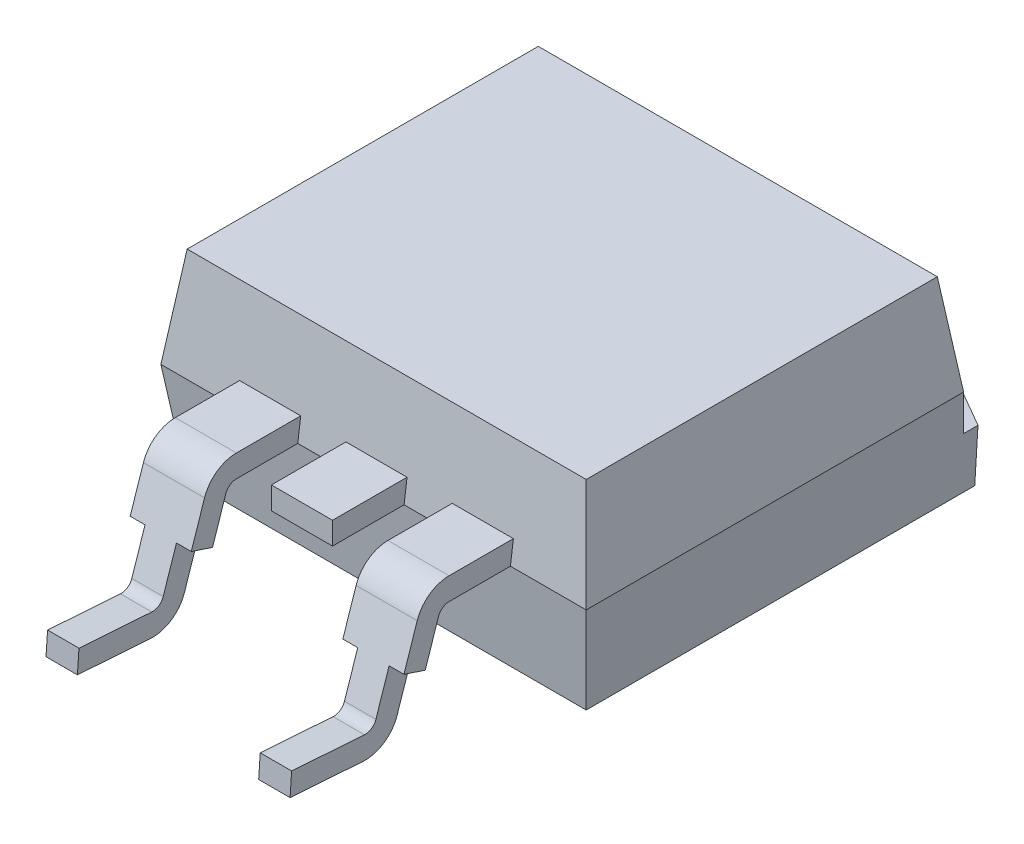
ISO-10303-21;
HEADER;
FILE_DESCRIPTION(('STEP AP214'),'2;1');
FILE_NAME('part.step','',(''),(''),'','','');
FILE_SCHEMA(('AUTOMOTIVE_DESIGN { 1 0 10303 214 1 1 1 1 }'));
ENDSEC;
DATA;
#1=APPLICATION_CONTEXT('core data for automotive mechanical design processes');
#2=APPLICATION_PROTOCOL_DEFINITION('international standard','automotive_design',2000,#1);
#3=PRODUCT_CONTEXT('',#1,'mechanical');
#4=PRODUCT('Part','Part','',(#3));
#5=PRODUCT_RELATED_PRODUCT_CATEGORY('part','',(#4));
#6=PRODUCT_DEFINITION_FORMATION('','',#4);
#7=PRODUCT_DEFINITION_CONTEXT('part definition',#1,'design');
#8=PRODUCT_DEFINITION('design','',#6,#7);
#9=PRODUCT_DEFINITION_SHAPE('','',#8);
#10=(LENGTH_UNIT() NAMED_UNIT(*) SI_UNIT(.MILLI.,.METRE.));
#11=(NAMED_UNIT(*) PLANE_ANGLE_UNIT() SI_UNIT($,.RADIAN.));
#12=(NAMED_UNIT(*) SI_UNIT($,.STERADIAN.) SOLID_ANGLE_UNIT());
#13=UNCERTAINTY_MEASURE_WITH_UNIT(LENGTH_MEASURE(1.E-05),#10,'distance_accuracy_value','');
#14=(GEOMETRIC_REPRESENTATION_CONTEXT(3) GLOBAL_UNCERTAINTY_ASSIGNED_CONTEXT((#13)) GLOBAL_UNIT_ASSIGNED_CONTEXT((#10,
#11,#12)) REPRESENTATION_CONTEXT('',''));
#15=CARTESIAN_POINT('',(0.,0.,0.));
#16=DIRECTION('',(0.,0.,1.));
#17=DIRECTION('',(1.,0.,0.));
#18=AXIS2_PLACEMENT_3D('',#15,#16,#17);
#19=CARTESIAN_POINT('',(-5.08,-2.385,4.5075));
#20=DIRECTION('',(0.,1.,0.));
#21=DIRECTION('',(0.,0.,1.));
#22=AXIS2_PLACEMENT_3D('',#19,#20,#21);
#23=PLANE('',#22);
#24=DIRECTION('',(-1.,0.,0.));
#25=VECTOR('',#24,1.);
#26=CARTESIAN_POINT('',(-5.08,-2.385,-4.57266798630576));
#27=LINE('',#26,#25);
#28=CARTESIAN_POINT('',(-2.25,-2.385,-4.57266798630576));
#29=VERTEX_POINT('',#28);
#30=CARTESIAN_POINT('',(-4.76600879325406,-2.385,-4.57266798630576));
#31=VERTEX_POINT('',#30);
#32=EDGE_CURVE('E11',#29,#31,#27,.T.);
#33=ORIENTED_EDGE('',*,*,#32,.F.);
#34=DIRECTION('',(0.,0.,-1.));
#35=VECTOR('',#34,1.);
#36=CARTESIAN_POINT('',(-2.25,-2.385,4.5075));
#37=LINE('',#36,#35);
#38=CARTESIAN_POINT('',(-2.25,-2.385,-3.77266798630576));
#39=VERTEX_POINT('',#38);
#40=EDGE_CURVE('E606',#39,#29,#37,.T.);
#41=ORIENTED_EDGE('',*,*,#40,.F.);
#42=DIRECTION('',(1.,0.,0.));
#43=VECTOR('',#42,1.);
#44=CARTESIAN_POINT('',(-5.08,-2.385,-3.77266798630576));
#45=LINE('',#44,#43);
#46=CARTESIAN_POINT('',(-3.44461154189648,-2.385,-3.77266798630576));
#47=VERTEX_POINT('',#46);
#48=EDGE_CURVE('E610',#47,#39,#45,.T.);
#49=ORIENTED_EDGE('',*,*,#48,.F.);
#50=DIRECTION('',(-0.0697564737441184,0.,-0.997564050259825));
#51=VECTOR('',#50,1.);
#52=CARTESIAN_POINT('',(-2.87638095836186,-2.385,4.35340794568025));
#53=LINE('',#52,#51);
#54=CARTESIAN_POINT('',(-3.11,-2.385,1.0125));
#55=VERTEX_POINT('',#54);
#56=EDGE_CURVE('E613',#55,#47,#53,.T.);
#57=ORIENTED_EDGE('',*,*,#56,.F.);
#58=DIRECTION('',(-1.,0.,0.));
#59=VECTOR('',#58,1.);
#60=CARTESIAN_POINT('',(-5.08,-2.385,1.0125));
#61=LINE('',#60,#59);
#62=CARTESIAN_POINT('',(3.11,-2.385,1.0125));
#63=VERTEX_POINT('',#62);
#64=EDGE_CURVE('E616',#63,#55,#61,.T.);
#65=ORIENTED_EDGE('',*,*,#64,.F.);
#66=DIRECTION('',(-0.0697564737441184,0.,0.997564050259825));
#67=VECTOR('',#66,1.);
#68=CARTESIAN_POINT('',(2.82694274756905,-2.385,5.06040729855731));
#69=LINE('',#68,#67);
#70=CARTESIAN_POINT('',(3.44461154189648,-2.385,-3.77266798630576));
#71=VERTEX_POINT('',#70);
#72=EDGE_CURVE('E619',#71,#63,#69,.T.);
#73=ORIENTED_EDGE('',*,*,#72,.F.);
#74=DIRECTION('',(1.,0.,0.));
#75=VECTOR('',#74,1.);
#76=CARTESIAN_POINT('',(-5.08,-2.385,-3.77266798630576));
#77=LINE('',#76,#75);
#78=CARTESIAN_POINT('',(2.25,-2.385,-3.77266798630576));
#79=VERTEX_POINT('',#78);
#80=EDGE_CURVE('E622',#79,#71,#77,.T.);
#81=ORIENTED_EDGE('',*,*,#80,.F.);
#82=DIRECTION('',(0.,0.,1.));
#83=VECTOR('',#82,1.);
#84=CARTESIAN_POINT('',(2.25,-2.385,4.5075));
#85=LINE('',#84,#83);
#86=CARTESIAN_POINT('',(2.25,-2.385,-4.57266798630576));
#87=VERTEX_POINT('',#86);
#88=EDGE_CURVE('E56',#87,#79,#85,.T.);
#89=ORIENTED_EDGE('',*,*,#88,.F.);
#90=DIRECTION('',(-1.,0.,0.));
#91=VECTOR('',#90,1.);
#92=CARTESIAN_POINT('',(-5.08,-2.385,-4.57266798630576));
#93=LINE('',#92,#91);
#94=CARTESIAN_POINT('',(4.76600879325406,-2.385,-4.57266798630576));
#95=VERTEX_POINT('',#94);
#96=EDGE_CURVE('E46',#95,#87,#93,.T.);
#97=ORIENTED_EDGE('',*,*,#96,.F.);
#98=DIRECTION('',(0.,0.,-1.));
#99=VECTOR('',#98,1.);
#100=CARTESIAN_POINT('',(4.76600879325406,-2.385,4.5075));
#101=LINE('',#100,#99);
#102=CARTESIAN_POINT('',(4.76600879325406,-2.385,4.19350879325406));
#103=VERTEX_POINT('',#102);
#104=EDGE_CURVE('E579',#103,#95,#101,.T.);
#105=ORIENTED_EDGE('',*,*,#104,.F.);
#106=DIRECTION('',(1.,0.,0.));
#107=VECTOR('',#106,1.);
#108=CARTESIAN_POINT('',(-5.08,-2.385,4.19350879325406));
#109=LINE('',#108,#107);
#110=CARTESIAN_POINT('',(-4.76600879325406,-2.385,4.19350879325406));
#111=VERTEX_POINT('',#110);
#112=EDGE_CURVE('E586',#111,#103,#109,.T.);
#113=ORIENTED_EDGE('',*,*,#112,.F.);
#114=DIRECTION('',(0.,0.,1.));
#115=VECTOR('',#114,1.);
#116=CARTESIAN_POINT('',(-4.76600879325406,-2.385,4.5075));
#117=LINE('',#116,#115);
#118=EDGE_CURVE('E575',#31,#111,#117,.T.);
#119=ORIENTED_EDGE('',*,*,#118,.F.);
#120=EDGE_LOOP('',(#33,#41,#49,#57,#65,#73,#81,#89,#97,#105,#113,#119));
#121=FACE_BOUND('',#120,.T.);
#122=ADVANCED_FACE('F37',(#121),#23,.F.);
#123=CARTESIAN_POINT('',(-3.27,-0.183170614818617,6.2267116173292));
#124=DIRECTION('',(0.,-0.315250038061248,-0.949008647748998));
#125=DIRECTION('',(0.,0.949008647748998,-0.315250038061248));
#126=AXIS2_PLACEMENT_3D('',#123,#124,#125);
#127=PLANE('',#126);
#128=DIRECTION('',(0.,0.949008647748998,-0.315250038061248));
#129=VECTOR('',#128,1.);
#130=CARTESIAN_POINT('',(-1.81,-0.183170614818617,6.2267116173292));
#131=LINE('',#130,#129);
#132=CARTESIAN_POINT('',(-1.81,-1.13432938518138,6.54267590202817));
#133=VERTEX_POINT('',#132);
#134=CARTESIAN_POINT('',(-1.81,-0.183170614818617,6.2267116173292));
#135=VERTEX_POINT('',#134);
#136=EDGE_CURVE('E382',#133,#135,#131,.T.);
#137=ORIENTED_EDGE('',*,*,#136,.F.);
#138=DIRECTION('',(1.,0.,0.));
#139=VECTOR('',#138,1.);
#140=CARTESIAN_POINT('',(-1.81,-1.13432938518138,6.54267590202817));
#141=LINE('',#140,#139);
#142=CARTESIAN_POINT('',(-2.165,-1.13432938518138,6.54267590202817));
#143=VERTEX_POINT('',#142);
#144=EDGE_CURVE('E363',#143,#133,#141,.T.);
#145=ORIENTED_EDGE('',*,*,#144,.F.);
#146=DIRECTION('',(0.,0.949008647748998,-0.315250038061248));
#147=VECTOR('',#146,1.);
#148=CARTESIAN_POINT('',(-2.165,-3.23419546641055,7.24022788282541));
#149=LINE('',#148,#147);
#150=CARTESIAN_POINT('',(-2.165,-2.08548815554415,6.85864018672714));
#151=VERTEX_POINT('',#150);
#152=EDGE_CURVE('E368',#151,#143,#149,.T.);
#153=ORIENTED_EDGE('',*,*,#152,.F.);
#154=DIRECTION('',(1.,0.,0.));
#155=VECTOR('',#154,1.);
#156=CARTESIAN_POINT('',(-3.27,-2.08548815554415,6.85864018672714));
#157=LINE('',#156,#155);
#158=CARTESIAN_POINT('',(-2.915,-2.08548815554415,6.85864018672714));
#159=VERTEX_POINT('',#158);
#160=EDGE_CURVE('E413',#159,#151,#157,.T.);
#161=ORIENTED_EDGE('',*,*,#160,.F.);
#162=DIRECTION('',(0.,-0.949008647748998,0.315250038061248));
#163=VECTOR('',#162,1.);
#164=CARTESIAN_POINT('',(-2.915,-3.23419546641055,7.24022788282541));
#165=LINE('',#164,#163);
#166=CARTESIAN_POINT('',(-2.915,-1.13432938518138,6.54267590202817));
#167=VERTEX_POINT('',#166);
#168=EDGE_CURVE('E792',#167,#159,#165,.T.);
#169=ORIENTED_EDGE('',*,*,#168,.F.);
#170=DIRECTION('',(1.,0.,0.));
#171=VECTOR('',#170,1.);
#172=CARTESIAN_POINT('',(-3.27,-1.13432938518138,6.54267590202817));
#173=LINE('',#172,#171);
#174=CARTESIAN_POINT('',(-3.27,-1.13432938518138,6.54267590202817));
#175=VERTEX_POINT('',#174);
#176=EDGE_CURVE('E806',#175,#167,#173,.T.);
#177=ORIENTED_EDGE('',*,*,#176,.F.);
#178=DIRECTION('',(0.,0.949008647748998,-0.315250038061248));
#179=VECTOR('',#178,1.);
#180=CARTESIAN_POINT('',(-3.27,-0.183170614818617,6.2267116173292));
#181=LINE('',#180,#179);
#182=CARTESIAN_POINT('',(-3.27,-0.183170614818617,6.2267116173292));
#183=VERTEX_POINT('',#182);
#184=EDGE_CURVE('E740',#175,#183,#181,.T.);
#185=ORIENTED_EDGE('',*,*,#184,.T.);
#186=DIRECTION('',(1.,0.,0.));
#187=VECTOR('',#186,1.);
#188=CARTESIAN_POINT('',(-3.27,-0.183170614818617,6.2267116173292));
#189=LINE('',#188,#187);
#190=EDGE_CURVE('E416',#183,#135,#189,.T.);
#191=ORIENTED_EDGE('',*,*,#190,.T.);
#192=EDGE_LOOP('',(#137,#145,#153,#161,#169,#177,#185,#191));
#193=FACE_BOUND('',#192,.T.);
#194=ADVANCED_FACE('F851',(#193),#127,.T.);
#195=CARTESIAN_POINT('',(-3.27,-1.8325,7.62021962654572));
#196=DIRECTION('',(1.,0.,0.));
#197=DIRECTION('',(0.,0.,-1.));
#198=AXIS2_PLACEMENT_3D('',#195,#196,#197);
#199=CYLINDRICAL_SURFACE('',#198,0.8025);
#200=ORIENTED_EDGE('',*,*,#160,.T.);
#201=CARTESIAN_POINT('',(-2.165,-1.8325,7.62021962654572));
#202=DIRECTION('',(1.,0.,0.));
#203=DIRECTION('',(0.,0.,-1.));
#204=AXIS2_PLACEMENT_3D('',#201,#202,#203);
#205=CIRCLE('',#204,0.8025);
#206=CARTESIAN_POINT('',(-2.165,-2.63304515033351,7.67619919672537));
#207=VERTEX_POINT('',#206);
#208=EDGE_CURVE('E821',#207,#151,#205,.T.);
#209=ORIENTED_EDGE('',*,*,#208,.F.);
#210=DIRECTION('',(1.,0.,0.));
#211=VECTOR('',#210,1.);
#212=CARTESIAN_POINT('',(-3.27,-2.63304515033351,7.67619919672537));
#213=LINE('',#212,#211);
#214=CARTESIAN_POINT('',(-2.915,-2.63304515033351,7.67619919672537));
#215=VERTEX_POINT('',#214);
#216=EDGE_CURVE('E410',#215,#207,#213,.T.);
#217=ORIENTED_EDGE('',*,*,#216,.F.);
#218=CARTESIAN_POINT('',(-2.915,-1.8325,7.62021962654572));
#219=DIRECTION('',(-1.,0.,0.));
#220=DIRECTION('',(0.,0.,1.));
#221=AXIS2_PLACEMENT_3D('',#218,#219,#220);
#222=CIRCLE('',#221,0.8025);
#223=EDGE_CURVE('E794',#159,#215,#222,.T.);
#224=ORIENTED_EDGE('',*,*,#223,.F.);
#225=EDGE_LOOP('',(#200,#209,#217,#224));
#226=FACE_BOUND('',#225,.T.);
#227=ADVANCED_FACE('F857',(#226),#199,.T.);
#228=CARTESIAN_POINT('',(-3.27,-2.63304515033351,7.67619919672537));
#229=DIRECTION('',(0.,-0.997564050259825,0.0697564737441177));
#230=DIRECTION('',(0.,-0.0697564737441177,-0.997564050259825));
#231=AXIS2_PLACEMENT_3D('',#228,#229,#230);
#232=PLANE('',#231);
#233=ORIENTED_EDGE('',*,*,#216,.T.);
#234=DIRECTION('',(0.,-0.0697564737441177,-0.997564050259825));
#235=VECTOR('',#234,1.);
#236=CARTESIAN_POINT('',(-2.165,-3.49290128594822,-4.62031642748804));
#237=LINE('',#236,#235);
#238=CARTESIAN_POINT('',(-2.165,-2.51137524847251,9.41615985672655));
#239=VERTEX_POINT('',#238);
#240=EDGE_CURVE('E823',#239,#207,#237,.T.);
#241=ORIENTED_EDGE('',*,*,#240,.F.);
#242=DIRECTION('',(1.,0.,0.));
#243=VECTOR('',#242,1.);
#244=CARTESIAN_POINT('',(-3.27,-2.51137524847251,9.41615985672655));
#245=LINE('',#244,#243);
#246=CARTESIAN_POINT('',(-2.915,-2.51137524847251,9.41615985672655));
#247=VERTEX_POINT('',#246);
#248=EDGE_CURVE('E407',#247,#239,#245,.T.);
#249=ORIENTED_EDGE('',*,*,#248,.F.);
#250=DIRECTION('',(0.,0.0697564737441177,0.997564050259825));
#251=VECTOR('',#250,1.);
#252=CARTESIAN_POINT('',(-2.915,-3.49290128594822,-4.62031642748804));
#253=LINE('',#252,#251);
#254=EDGE_CURVE('E813',#215,#247,#253,.T.);
#255=ORIENTED_EDGE('',*,*,#254,.F.);
#256=EDGE_LOOP('',(#233,#241,#249,#255));
#257=FACE_BOUND('',#256,.T.);
#258=ADVANCED_FACE('F861',(#257),#232,.T.);
#259=CARTESIAN_POINT('',(-3.27,-2.51137524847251,9.41615985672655));
#260=DIRECTION('',(0.,0.0697564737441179,0.997564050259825));
#261=DIRECTION('',(0.,-0.997564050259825,0.0697564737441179));
#262=AXIS2_PLACEMENT_3D('',#259,#260,#261);
#263=PLANE('',#262);
#264=ORIENTED_EDGE('',*,*,#248,.T.);
#265=DIRECTION('',(0.,-0.997564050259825,0.0697564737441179));
#266=VECTOR('',#265,1.);
#267=CARTESIAN_POINT('',(-2.165,-6.10903954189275,9.6677330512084));
#268=LINE('',#267,#266);
#269=CARTESIAN_POINT('',(-2.165,-1.97767848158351,9.37884014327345));
#270=VERTEX_POINT('',#269);
#271=EDGE_CURVE('E825',#270,#239,#268,.T.);
#272=ORIENTED_EDGE('',*,*,#271,.F.);
#273=DIRECTION('',(1.,0.,0.));
#274=VECTOR('',#273,1.);
#275=CARTESIAN_POINT('',(-3.27,-1.97767848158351,9.37884014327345));
#276=LINE('',#275,#274);
#277=CARTESIAN_POINT('',(-2.915,-1.97767848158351,9.37884014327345));
#278=VERTEX_POINT('',#277);
#279=EDGE_CURVE('E404',#278,#270,#276,.T.);
#280=ORIENTED_EDGE('',*,*,#279,.F.);
#281=DIRECTION('',(0.,0.997564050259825,-0.0697564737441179));
#282=VECTOR('',#281,1.);
#283=CARTESIAN_POINT('',(-2.915,-6.10903954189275,9.6677330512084));
#284=LINE('',#283,#282);
#285=EDGE_CURVE('E815',#247,#278,#284,.T.);
#286=ORIENTED_EDGE('',*,*,#285,.F.);
#287=EDGE_LOOP('',(#264,#272,#280,#286));
#288=FACE_BOUND('',#287,.T.);
#289=ADVANCED_FACE('F867',(#288),#263,.T.);
#290=CARTESIAN_POINT('',(-3.27,-2.0993483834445,7.63887948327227));
#291=DIRECTION('',(0.,0.997564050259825,-0.069756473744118));
#292=DIRECTION('',(0.,0.069756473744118,0.997564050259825));
#293=AXIS2_PLACEMENT_3D('',#290,#291,#292);
#294=PLANE('',#293);
#295=ORIENTED_EDGE('',*,*,#279,.T.);
#296=DIRECTION('',(0.,0.069756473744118,0.997564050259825));
#297=VECTOR('',#296,1.);
#298=CARTESIAN_POINT('',(-2.165,-2.95920451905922,-4.65763614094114));
#299=LINE('',#298,#297);
#300=CARTESIAN_POINT('',(-2.165,-2.0993483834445,7.63887948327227));
#301=VERTEX_POINT('',#300);
#302=EDGE_CURVE('E827',#301,#270,#299,.T.);
#303=ORIENTED_EDGE('',*,*,#302,.F.);
#304=DIRECTION('',(1.,0.,0.));
#305=VECTOR('',#304,1.);
#306=CARTESIAN_POINT('',(-3.27,-2.0993483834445,7.63887948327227));
#307=LINE('',#306,#305);
#308=CARTESIAN_POINT('',(-2.915,-2.0993483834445,7.63887948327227));
#309=VERTEX_POINT('',#308);
#310=EDGE_CURVE('E401',#309,#301,#307,.T.);
#311=ORIENTED_EDGE('',*,*,#310,.F.);
#312=DIRECTION('',(0.,-0.069756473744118,-0.997564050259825));
#313=VECTOR('',#312,1.);
#314=CARTESIAN_POINT('',(-2.915,-2.95920451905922,-4.65763614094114));
#315=LINE('',#314,#313);
#316=EDGE_CURVE('E796',#278,#309,#315,.T.);
#317=ORIENTED_EDGE('',*,*,#316,.F.);
#318=EDGE_LOOP('',(#295,#303,#311,#317));
#319=FACE_BOUND('',#318,.T.);
#320=ADVANCED_FACE('F870',(#319),#294,.T.);
#321=CARTESIAN_POINT('',(-3.27,-1.8325,7.62021962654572));
#322=DIRECTION('',(1.,0.,0.));
#323=DIRECTION('',(0.,0.,-1.));
#324=AXIS2_PLACEMENT_3D('',#321,#322,#323);
#325=CYLINDRICAL_SURFACE('',#324,0.2675);
#326=ORIENTED_EDGE('',*,*,#310,.T.);
#327=CARTESIAN_POINT('',(-2.165,-1.8325,7.62021962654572));
#328=DIRECTION('',(1.,0.,0.));
#329=DIRECTION('',(0.,0.,-1.));
#330=AXIS2_PLACEMENT_3D('',#327,#328,#329);
#331=CIRCLE('',#330,0.2675);
#332=CARTESIAN_POINT('',(-2.165,-1.91682938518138,7.36635981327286));
#333=VERTEX_POINT('',#332);
#334=EDGE_CURVE('E829',#333,#301,#331,.F.);
#335=ORIENTED_EDGE('',*,*,#334,.F.);
#336=DIRECTION('',(1.,0.,0.));
#337=VECTOR('',#336,1.);
#338=CARTESIAN_POINT('',(-3.27,-1.91682938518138,7.36635981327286));
#339=LINE('',#338,#337);
#340=CARTESIAN_POINT('',(-2.915,-1.91682938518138,7.36635981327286));
#341=VERTEX_POINT('',#340);
#342=EDGE_CURVE('E399',#341,#333,#339,.T.);
#343=ORIENTED_EDGE('',*,*,#342,.F.);
#344=CARTESIAN_POINT('',(-2.915,-1.8325,7.62021962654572));
#345=DIRECTION('',(-1.,0.,0.));
#346=DIRECTION('',(0.,0.,1.));
#347=AXIS2_PLACEMENT_3D('',#344,#345,#346);
#348=CIRCLE('',#347,0.2675);
#349=EDGE_CURVE('E798',#309,#341,#348,.F.);
#350=ORIENTED_EDGE('',*,*,#349,.F.);
#351=EDGE_LOOP('',(#326,#335,#343,#350));
#352=FACE_BOUND('',#351,.T.);
#353=ADVANCED_FACE('F837',(#352),#325,.F.);
#354=CARTESIAN_POINT('',(-3.27,-0.0145118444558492,6.73443124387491));
#355=DIRECTION('',(0.,0.315250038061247,0.949008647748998));
#356=DIRECTION('',(0.,-0.949008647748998,0.315250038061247));
#357=AXIS2_PLACEMENT_3D('',#354,#355,#356);
#358=PLANE('',#357);
#359=DIRECTION('',(0.,-0.949008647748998,0.315250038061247));
#360=VECTOR('',#359,1.);
#361=CARTESIAN_POINT('',(-2.165,-3.06553669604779,7.74794750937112));
#362=LINE('',#361,#360);
#363=CARTESIAN_POINT('',(-2.165,-0.965670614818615,7.05039552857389));
#364=VERTEX_POINT('',#363);
#365=EDGE_CURVE('E376',#364,#333,#362,.T.);
#366=ORIENTED_EDGE('',*,*,#365,.F.);
#367=DIRECTION('',(-1.,0.,0.));
#368=VECTOR('',#367,1.);
#369=CARTESIAN_POINT('',(-1.81,-0.965670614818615,7.05039552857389));
#370=LINE('',#369,#368);
#371=CARTESIAN_POINT('',(-1.81,-0.965670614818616,7.05039552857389));
#372=VERTEX_POINT('',#371);
#373=EDGE_CURVE('E360',#372,#364,#370,.T.);
#374=ORIENTED_EDGE('',*,*,#373,.F.);
#375=DIRECTION('',(0.,-0.949008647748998,0.315250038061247));
#376=VECTOR('',#375,1.);
#377=CARTESIAN_POINT('',(-1.81,-0.0145118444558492,6.73443124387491));
#378=LINE('',#377,#376);
#379=CARTESIAN_POINT('',(-1.81,-0.0145118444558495,6.73443124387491));
#380=VERTEX_POINT('',#379);
#381=EDGE_CURVE('E373',#380,#372,#378,.T.);
#382=ORIENTED_EDGE('',*,*,#381,.F.);
#383=DIRECTION('',(1.,0.,0.));
#384=VECTOR('',#383,1.);
#385=CARTESIAN_POINT('',(-3.27,-0.0145118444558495,6.73443124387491));
#386=LINE('',#385,#384);
#387=CARTESIAN_POINT('',(-3.27,-0.0145118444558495,6.73443124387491));
#388=VERTEX_POINT('',#387);
#389=EDGE_CURVE('E397',#388,#380,#386,.T.);
#390=ORIENTED_EDGE('',*,*,#389,.F.);
#391=DIRECTION('',(0.,-0.949008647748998,0.315250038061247));
#392=VECTOR('',#391,1.);
#393=CARTESIAN_POINT('',(-3.27,-0.0145118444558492,6.73443124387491));
#394=LINE('',#393,#392);
#395=CARTESIAN_POINT('',(-3.27,-0.965670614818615,7.05039552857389));
#396=VERTEX_POINT('',#395);
#397=EDGE_CURVE('E737',#388,#396,#394,.T.);
#398=ORIENTED_EDGE('',*,*,#397,.T.);
#399=DIRECTION('',(-1.,0.,0.));
#400=VECTOR('',#399,1.);
#401=CARTESIAN_POINT('',(-3.27,-0.965670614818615,7.05039552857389));
#402=LINE('',#401,#400);
#403=CARTESIAN_POINT('',(-2.915,-0.965670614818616,7.05039552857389));
#404=VERTEX_POINT('',#403);
#405=EDGE_CURVE('E811',#404,#396,#402,.T.);
#406=ORIENTED_EDGE('',*,*,#405,.F.);
#407=DIRECTION('',(0.,0.949008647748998,-0.315250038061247));
#408=VECTOR('',#407,1.);
#409=CARTESIAN_POINT('',(-2.915,-3.06553669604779,7.74794750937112));
#410=LINE('',#409,#408);
#411=EDGE_CURVE('E800',#341,#404,#410,.T.);
#412=ORIENTED_EDGE('',*,*,#411,.F.);
#413=ORIENTED_EDGE('',*,*,#342,.T.);
#414=EDGE_LOOP('',(#366,#374,#382,#390,#398,#406,#412,#413));
#415=FACE_BOUND('',#414,.T.);
#416=ADVANCED_FACE('F372',(#415),#358,.T.);
#417=CARTESIAN_POINT('',(-1.81,-0.267500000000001,5.97285180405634));
#418=DIRECTION('',(-1.,0.,0.));
#419=DIRECTION('',(0.,0.,-1.));
#420=AXIS2_PLACEMENT_3D('',#417,#418,#419);
#421=PLANE('',#420);
#422=DIRECTION('',(0.,0.315250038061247,0.949008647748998));
#423=VECTOR('',#422,1.);
#424=CARTESIAN_POINT('',(-1.81,-4.99069949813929,-5.06629521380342));
#425=LINE('',#424,#423);
#426=EDGE_CURVE('E357',#133,#372,#425,.T.);
#427=ORIENTED_EDGE('',*,*,#426,.F.);
#428=ORIENTED_EDGE('',*,*,#136,.T.);
#429=CARTESIAN_POINT('',(-1.81,-0.267500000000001,5.97285180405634));
#430=DIRECTION('',(-1.,0.,0.));
#431=DIRECTION('',(0.,0.,-1.));
#432=AXIS2_PLACEMENT_3D('',#429,#430,#431);
#433=CIRCLE('',#432,0.2675);
#434=CARTESIAN_POINT('',(-1.81,0.,5.97285180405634));
#435=VERTEX_POINT('',#434);
#436=EDGE_CURVE('E386',#135,#435,#433,.T.);
#437=ORIENTED_EDGE('',*,*,#436,.T.);
#438=DIRECTION('',(0.,0.,-1.));
#439=VECTOR('',#438,1.);
#440=CARTESIAN_POINT('',(-1.81,0.,4.43706591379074));
#441=LINE('',#440,#439);
#442=CARTESIAN_POINT('',(-1.81,0.,4.5075));
#443=VERTEX_POINT('',#442);
#444=EDGE_CURVE('E722',#435,#443,#441,.T.);
#445=ORIENTED_EDGE('',*,*,#444,.T.);
#446=DIRECTION('',(0.,-0.99144486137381,0.130526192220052));
#447=VECTOR('',#446,1.);
#448=CARTESIAN_POINT('',(-1.81,0.,4.5075));
#449=LINE('',#448,#447);
#450=CARTESIAN_POINT('',(-1.81,0.534999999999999,4.43706591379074));
#451=VERTEX_POINT('',#450);
#452=EDGE_CURVE('E601',#443,#451,#449,.F.);
#453=ORIENTED_EDGE('',*,*,#452,.T.);
#454=DIRECTION('',(0.,0.,1.));
#455=VECTOR('',#454,1.);
#456=CARTESIAN_POINT('',(-1.81,0.534999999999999,4.43706591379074));
#457=LINE('',#456,#455);
#458=CARTESIAN_POINT('',(-1.81,0.534999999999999,5.97285180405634));
#459=VERTEX_POINT('',#458);
#460=EDGE_CURVE('E384',#451,#459,#457,.T.);
#461=ORIENTED_EDGE('',*,*,#460,.T.);
#462=CARTESIAN_POINT('',(-1.81,-0.267500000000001,5.97285180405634));
#463=DIRECTION('',(1.,0.,0.));
#464=DIRECTION('',(0.,0.,-1.));
#465=AXIS2_PLACEMENT_3D('',#462,#463,#464);
#466=CIRCLE('',#465,0.8025);
#467=EDGE_CURVE('E381',#459,#380,#466,.T.);
#468=ORIENTED_EDGE('',*,*,#467,.T.);
#469=ORIENTED_EDGE('',*,*,#381,.T.);
#470=EDGE_LOOP('',(#427,#428,#437,#445,#453,#461,#468,#469));
#471=FACE_BOUND('',#470,.T.);
#472=ADVANCED_FACE('F378',(#471),#421,.F.);
#473=CARTESIAN_POINT('',(-3.27,-0.267500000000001,5.97285180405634));
#474=DIRECTION('',(-1.,0.,0.));
#475=DIRECTION('',(0.,0.,-1.));
#476=AXIS2_PLACEMENT_3D('',#473,#474,#475);
#477=PLANE('',#476);
#478=ORIENTED_EDGE('',*,*,#184,.F.);
#479=DIRECTION('',(0.,0.315250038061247,0.949008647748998));
#480=VECTOR('',#479,1.);
#481=CARTESIAN_POINT('',(-3.27,-4.99069949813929,-5.06629521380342));
#482=LINE('',#481,#480);
#483=EDGE_CURVE('E802',#175,#396,#482,.T.);
#484=ORIENTED_EDGE('',*,*,#483,.T.);
#485=ORIENTED_EDGE('',*,*,#397,.F.);
#486=CARTESIAN_POINT('',(-3.27,-0.267500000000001,5.97285180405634));
#487=DIRECTION('',(1.,0.,0.));
#488=DIRECTION('',(0.,0.,-1.));
#489=AXIS2_PLACEMENT_3D('',#486,#487,#488);
#490=CIRCLE('',#489,0.8025);
#491=CARTESIAN_POINT('',(-3.27,0.534999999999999,5.97285180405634));
#492=VERTEX_POINT('',#491);
#493=EDGE_CURVE('E734',#492,#388,#490,.T.);
#494=ORIENTED_EDGE('',*,*,#493,.F.);
#495=DIRECTION('',(0.,0.,1.));
#496=VECTOR('',#495,1.);
#497=CARTESIAN_POINT('',(-3.27,0.534999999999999,4.43706591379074));
#498=LINE('',#497,#496);
#499=CARTESIAN_POINT('',(-3.27,0.534999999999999,4.43706591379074));
#500=VERTEX_POINT('',#499);
#501=EDGE_CURVE('E395',#500,#492,#498,.T.);
#502=ORIENTED_EDGE('',*,*,#501,.F.);
#503=DIRECTION('',(0.,-0.99144486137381,0.130526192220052));
#504=VECTOR('',#503,1.);
#505=CARTESIAN_POINT('',(-3.27,0.,4.5075));
#506=LINE('',#505,#504);
#507=CARTESIAN_POINT('',(-3.27,0.,4.5075));
#508=VERTEX_POINT('',#507);
#509=EDGE_CURVE('E604',#508,#500,#506,.F.);
#510=ORIENTED_EDGE('',*,*,#509,.F.);
#511=DIRECTION('',(0.,0.,-1.));
#512=VECTOR('',#511,1.);
#513=CARTESIAN_POINT('',(-3.27,0.,4.43706591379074));
#514=LINE('',#513,#512);
#515=CARTESIAN_POINT('',(-3.27,0.,5.97285180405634));
#516=VERTEX_POINT('',#515);
#517=EDGE_CURVE('E391',#516,#508,#514,.T.);
#518=ORIENTED_EDGE('',*,*,#517,.F.);
#519=CARTESIAN_POINT('',(-3.27,-0.267500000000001,5.97285180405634));
#520=DIRECTION('',(-1.,0.,0.));
#521=DIRECTION('',(0.,0.,-1.));
#522=AXIS2_PLACEMENT_3D('',#519,#520,#521);
#523=CIRCLE('',#522,0.2675);
#524=EDGE_CURVE('E742',#183,#516,#523,.T.);
#525=ORIENTED_EDGE('',*,*,#524,.F.);
#526=EDGE_LOOP('',(#478,#484,#485,#494,#502,#510,#518,#525));
#527=FACE_BOUND('',#526,.T.);
#528=ADVANCED_FACE('F876',(#527),#477,.T.);
#529=CARTESIAN_POINT('',(-5.08,0.,-4.5075));
#530=DIRECTION('',(-0.99144486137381,-0.130526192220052,0.));
#531=DIRECTION('',(0.130526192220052,-0.99144486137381,0.));
#532=AXIS2_PLACEMENT_3D('',#529,#530,#531);
#533=PLANE('',#532);
#534=DIRECTION('',(0.130157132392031,-0.988641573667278,-0.0751462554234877));
#535=VECTOR('',#534,1.);
#536=CARTESIAN_POINT('',(-4.77002848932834,-2.3544673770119,-5.08518722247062));
#537=LINE('',#536,#535);
#538=CARTESIAN_POINT('',(-4.94966402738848,-0.99,-4.98147459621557));
#539=VERTEX_POINT('',#538);
#540=CARTESIAN_POINT('',(-4.76600879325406,-2.385,-5.08750799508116));
#541=VERTEX_POINT('',#540);
#542=EDGE_CURVE('E510',#539,#541,#537,.T.);
#543=ORIENTED_EDGE('',*,*,#542,.T.);
#544=EDGE_CURVE('E583',#541,#31,#117,.T.);
#545=ORIENTED_EDGE('',*,*,#544,.T.);
#546=ORIENTED_EDGE('',*,*,#118,.T.);
#547=DIRECTION('',(-0.129428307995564,0.98310560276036,0.129428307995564));
#548=VECTOR('',#547,1.);
#549=CARTESIAN_POINT('',(-4.92898354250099,-1.14708387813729,4.35648354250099));
#550=LINE('',#549,#548);
#551=CARTESIAN_POINT('',(-5.08,0.,4.5075));
#552=VERTEX_POINT('',#551);
#553=EDGE_CURVE('E576',#111,#552,#550,.T.);
#554=ORIENTED_EDGE('',*,*,#553,.T.);
#555=DIRECTION('',(0.,0.,1.));
#556=VECTOR('',#555,1.);
#557=CARTESIAN_POINT('',(-5.08,0.,-4.5075));
#558=LINE('',#557,#556);
#559=CARTESIAN_POINT('',(-5.08,0.,-4.5075));
#560=VERTEX_POINT('',#559);
#561=EDGE_CURVE('E547',#560,#552,#558,.T.);
#562=ORIENTED_EDGE('',*,*,#561,.F.);
#563=DIRECTION('',(-0.129428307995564,0.98310560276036,0.129428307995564));
#564=VECTOR('',#563,1.);
#565=CARTESIAN_POINT('',(-5.12619988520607,0.350922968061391,-4.46130011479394));
#566=LINE('',#565,#564);
#567=CARTESIAN_POINT('',(-4.94966402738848,-0.99,-4.63783597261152));
#568=VERTEX_POINT('',#567);
#569=EDGE_CURVE('E525',#568,#560,#566,.T.);
#570=ORIENTED_EDGE('',*,*,#569,.F.);
#571=DIRECTION('',(0.,0.,1.));
#572=VECTOR('',#571,1.);
#573=CARTESIAN_POINT('',(-4.94966402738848,-0.99,-4.63783597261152));
#574=LINE('',#573,#572);
#575=EDGE_CURVE('E524',#539,#568,#574,.T.);
#576=ORIENTED_EDGE('',*,*,#575,.F.);
#577=EDGE_LOOP('',(#543,#545,#546,#554,#562,#570,#576));
#578=FACE_BOUND('',#577,.T.);
#579=ADVANCED_FACE('F659',(#578),#533,.T.);
#580=CARTESIAN_POINT('',(5.08,0.,-4.5075));
#581=DIRECTION('',(0.99144486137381,-0.130526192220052,0.));
#582=DIRECTION('',(0.130526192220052,0.99144486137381,0.));
#583=AXIS2_PLACEMENT_3D('',#580,#581,#582);
#584=PLANE('',#583);
#585=DIRECTION('',(0.130157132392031,0.988641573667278,0.0751462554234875));
#586=VECTOR('',#585,1.);
#587=CARTESIAN_POINT('',(4.77002848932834,-2.3544673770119,-5.08518722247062));
#588=LINE('',#587,#586);
#589=CARTESIAN_POINT('',(4.76600879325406,-2.385,-5.08750799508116));
#590=VERTEX_POINT('',#589);
#591=CARTESIAN_POINT('',(4.94966402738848,-0.99,-4.98147459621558));
#592=VERTEX_POINT('',#591);
#593=EDGE_CURVE('E517',#590,#592,#588,.T.);
#594=ORIENTED_EDGE('',*,*,#593,.T.);
#595=DIRECTION('',(0.,0.,1.));
#596=VECTOR('',#595,1.);
#597=CARTESIAN_POINT('',(4.94966402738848,-0.99,-4.63783597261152));
#598=LINE('',#597,#596);
#599=CARTESIAN_POINT('',(4.94966402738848,-0.99,-4.63783597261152));
#600=VERTEX_POINT('',#599);
#601=EDGE_CURVE('E534',#592,#600,#598,.T.);
#602=ORIENTED_EDGE('',*,*,#601,.T.);
#603=DIRECTION('',(0.129428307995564,0.98310560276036,0.129428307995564));
#604=VECTOR('',#603,1.);
#605=CARTESIAN_POINT('',(5.12619988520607,0.350922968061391,-4.46130011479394));
#606=LINE('',#605,#604);
#607=CARTESIAN_POINT('',(5.08,0.,-4.5075));
#608=VERTEX_POINT('',#607);
#609=EDGE_CURVE('E530',#600,#608,#606,.T.);
#610=ORIENTED_EDGE('',*,*,#609,.T.);
#611=DIRECTION('',(0.,0.,-1.));
#612=VECTOR('',#611,1.);
#613=CARTESIAN_POINT('',(5.08,0.,-4.5075));
#614=LINE('',#613,#612);
#615=CARTESIAN_POINT('',(5.08,0.,4.5075));
#616=VERTEX_POINT('',#615);
#617=EDGE_CURVE('E570',#616,#608,#614,.T.);
#618=ORIENTED_EDGE('',*,*,#617,.F.);
#619=DIRECTION('',(0.129428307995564,0.98310560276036,0.129428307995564));
#620=VECTOR('',#619,1.);
#621=CARTESIAN_POINT('',(4.90980286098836,-1.29277561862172,4.33730286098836));
#622=LINE('',#621,#620);
#623=EDGE_CURVE('E578',#103,#616,#622,.T.);
#624=ORIENTED_EDGE('',*,*,#623,.F.);
#625=ORIENTED_EDGE('',*,*,#104,.T.);
#626=EDGE_CURVE('E589',#95,#590,#101,.T.);
#627=ORIENTED_EDGE('',*,*,#626,.T.);
#628=EDGE_LOOP('',(#594,#602,#610,#618,#624,#625,#627));
#629=FACE_BOUND('',#628,.T.);
#630=ADVANCED_FACE('F39',(#629),#584,.T.);
#631=CARTESIAN_POINT('',(-5.08,0.,4.5075));
#632=DIRECTION('',(0.,-0.130526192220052,0.99144486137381));
#633=DIRECTION('',(0.,-0.99144486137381,-0.130526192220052));
#634=AXIS2_PLACEMENT_3D('',#631,#632,#633);
#635=PLANE('',#634);
#636=DIRECTION('',(1.,0.,0.));
#637=VECTOR('',#636,1.);
#638=CARTESIAN_POINT('',(-5.08,0.,4.5075));
#639=LINE('',#638,#637);
#640=EDGE_CURVE('E567',#552,#508,#639,.T.);
#641=ORIENTED_EDGE('',*,*,#640,.F.);
#642=ORIENTED_EDGE('',*,*,#553,.F.);
#643=ORIENTED_EDGE('',*,*,#112,.T.);
#644=ORIENTED_EDGE('',*,*,#623,.T.);
#645=CARTESIAN_POINT('',(3.27,0.,4.5075));
#646=VERTEX_POINT('',#645);
#647=EDGE_CURVE('E566',#646,#616,#639,.T.);
#648=ORIENTED_EDGE('',*,*,#647,.F.);
#649=CARTESIAN_POINT('',(1.81,0.,4.5075));
#650=VERTEX_POINT('',#649);
#651=EDGE_CURVE('E573',#650,#646,#639,.T.);
#652=ORIENTED_EDGE('',*,*,#651,.F.);
#653=CARTESIAN_POINT('',(0.73,0.,4.5075));
#654=VERTEX_POINT('',#653);
#655=EDGE_CURVE('E711',#654,#650,#639,.T.);
#656=ORIENTED_EDGE('',*,*,#655,.F.);
#657=CARTESIAN_POINT('',(-0.73,0.,4.5075));
#658=VERTEX_POINT('',#657);
#659=EDGE_CURVE('E710',#658,#654,#639,.T.);
#660=ORIENTED_EDGE('',*,*,#659,.F.);
#661=EDGE_CURVE('E572',#443,#658,#639,.T.);
#662=ORIENTED_EDGE('',*,*,#661,.F.);
#663=EDGE_CURVE('E571',#508,#443,#639,.T.);
#664=ORIENTED_EDGE('',*,*,#663,.F.);
#665=EDGE_LOOP('',(#641,#642,#643,#644,#648,#652,#656,#660,#662,#664));
#666=FACE_BOUND('',#665,.T.);
#667=ADVANCED_FACE('F701',(#666),#635,.T.);
#668=ORIENTED_EDGE('',*,*,#40,.T.);
#669=ORIENTED_EDGE('',*,*,#32,.T.);
#670=ORIENTED_EDGE('',*,*,#544,.F.);
#671=DIRECTION('',(-0.866025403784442,0.,0.499999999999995));
#672=VECTOR('',#671,1.);
#673=CARTESIAN_POINT('',(-4.94966402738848,-2.385,-4.98147459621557));
#674=LINE('',#673,#672);
#675=CARTESIAN_POINT('',(-3.44966402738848,-2.385,-5.8475));
#676=VERTEX_POINT('',#675);
#677=EDGE_CURVE('E513',#676,#541,#674,.T.);
#678=ORIENTED_EDGE('',*,*,#677,.F.);
#679=DIRECTION('',(-1.,0.,0.));
#680=VECTOR('',#679,1.);
#681=CARTESIAN_POINT('',(7.83792434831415,-2.385,-5.8475));
#682=LINE('',#681,#680);
#683=CARTESIAN_POINT('',(3.44966402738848,-2.385,-5.8475));
#684=VERTEX_POINT('',#683);
#685=EDGE_CURVE('E528',#684,#676,#682,.T.);
#686=ORIENTED_EDGE('',*,*,#685,.F.);
#687=DIRECTION('',(-0.866025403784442,0.,-0.499999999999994));
#688=VECTOR('',#687,1.);
#689=CARTESIAN_POINT('',(4.94966402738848,-2.385,-4.98147459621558));
#690=LINE('',#689,#688);
#691=EDGE_CURVE('E520',#590,#684,#690,.T.);
#692=ORIENTED_EDGE('',*,*,#691,.F.);
#693=ORIENTED_EDGE('',*,*,#626,.F.);
#694=ORIENTED_EDGE('',*,*,#96,.T.);
#695=ORIENTED_EDGE('',*,*,#88,.T.);
#696=ORIENTED_EDGE('',*,*,#80,.T.);
#697=ORIENTED_EDGE('',*,*,#72,.T.);
#698=ORIENTED_EDGE('',*,*,#64,.T.);
#699=ORIENTED_EDGE('',*,*,#56,.T.);
#700=ORIENTED_EDGE('',*,*,#48,.T.);
#701=EDGE_LOOP('',(#668,#669,#670,#678,#686,#692,#693,#694,#695,#696,#697,#698,#699,#700));
#702=FACE_BOUND('',#701,.T.);
#703=ADVANCED_FACE('F646',(#702),#23,.F.);
#704=CARTESIAN_POINT('',(-5.08,0.,-4.5075));
#705=DIRECTION('',(-0.99144486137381,0.130526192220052,0.));
#706=DIRECTION('',(-0.130526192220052,-0.99144486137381,0.));
#707=AXIS2_PLACEMENT_3D('',#704,#705,#706);
#708=PLANE('',#707);
#709=ORIENTED_EDGE('',*,*,#561,.T.);
#710=DIRECTION('',(-0.129428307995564,-0.98310560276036,0.129428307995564));
#711=VECTOR('',#710,1.);
#712=CARTESIAN_POINT('',(-5.08,0.,4.5075));
#713=LINE('',#712,#711);
#714=CARTESIAN_POINT('',(-4.76600879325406,2.385,4.19350879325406));
#715=VERTEX_POINT('',#714);
#716=EDGE_CURVE('E544',#715,#552,#713,.T.);
#717=ORIENTED_EDGE('',*,*,#716,.F.);
#718=DIRECTION('',(0.,0.,-1.));
#719=VECTOR('',#718,1.);
#720=CARTESIAN_POINT('',(-4.76600879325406,2.385,-4.5075));
#721=LINE('',#720,#719);
#722=CARTESIAN_POINT('',(-4.76600879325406,2.385,-4.19350879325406));
#723=VERTEX_POINT('',#722);
#724=EDGE_CURVE('E533',#723,#715,#721,.F.);
#725=ORIENTED_EDGE('',*,*,#724,.F.);
#726=DIRECTION('',(-0.129428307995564,-0.98310560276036,-0.129428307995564));
#727=VECTOR('',#726,1.);
#728=CARTESIAN_POINT('',(-5.08,0.,-4.5075));
#729=LINE('',#728,#727);
#730=EDGE_CURVE('E549',#723,#560,#729,.T.);
#731=ORIENTED_EDGE('',*,*,#730,.T.);
#732=EDGE_LOOP('',(#709,#717,#725,#731));
#733=FACE_BOUND('',#732,.T.);
#734=ADVANCED_FACE('F688',(#733),#708,.T.);
#735=CARTESIAN_POINT('',(-5.08,0.,4.5075));
#736=DIRECTION('',(0.,0.130526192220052,0.99144486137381));
#737=DIRECTION('',(0.,-0.99144486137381,0.130526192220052));
#738=AXIS2_PLACEMENT_3D('',#735,#736,#737);
#739=PLANE('',#738);
#740=ORIENTED_EDGE('',*,*,#640,.T.);
#741=ORIENTED_EDGE('',*,*,#509,.T.);
#742=DIRECTION('',(1.,0.,0.));
#743=VECTOR('',#742,1.);
#744=CARTESIAN_POINT('',(-3.27,0.534999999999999,4.43706591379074));
#745=LINE('',#744,#743);
#746=EDGE_CURVE('E392',#500,#451,#745,.T.);
#747=ORIENTED_EDGE('',*,*,#746,.T.);
#748=ORIENTED_EDGE('',*,*,#452,.F.);
#749=ORIENTED_EDGE('',*,*,#661,.T.);
#750=DIRECTION('',(0.,0.99144486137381,-0.130526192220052));
#751=VECTOR('',#750,1.);
#752=CARTESIAN_POINT('',(-0.73,0.,4.5075));
#753=LINE('',#752,#751);
#754=CARTESIAN_POINT('',(-0.73,0.535,4.43706591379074));
#755=VERTEX_POINT('',#754);
#756=EDGE_CURVE('E596',#755,#658,#753,.F.);
#757=ORIENTED_EDGE('',*,*,#756,.F.);
#758=DIRECTION('',(-1.,0.,0.));
#759=VECTOR('',#758,1.);
#760=CARTESIAN_POINT('',(0.73,0.535,4.43706591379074));
#761=LINE('',#760,#759);
#762=CARTESIAN_POINT('',(0.730000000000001,0.535,4.43706591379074));
#763=VERTEX_POINT('',#762);
#764=EDGE_CURVE('E441',#763,#755,#761,.T.);
#765=ORIENTED_EDGE('',*,*,#764,.F.);
#766=DIRECTION('',(0.,0.99144486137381,-0.130526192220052));
#767=VECTOR('',#766,1.);
#768=CARTESIAN_POINT('',(0.73,0.,4.5075));
#769=LINE('',#768,#767);
#770=EDGE_CURVE('E599',#763,#654,#769,.F.);
#771=ORIENTED_EDGE('',*,*,#770,.T.);
#772=ORIENTED_EDGE('',*,*,#655,.T.);
#773=DIRECTION('',(0.,0.99144486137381,-0.130526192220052));
#774=VECTOR('',#773,1.);
#775=CARTESIAN_POINT('',(1.81,0.,4.5075));
#776=LINE('',#775,#774);
#777=CARTESIAN_POINT('',(1.81,0.535,4.43706591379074));
#778=VERTEX_POINT('',#777);
#779=EDGE_CURVE('E582',#778,#650,#776,.F.);
#780=ORIENTED_EDGE('',*,*,#779,.F.);
#781=DIRECTION('',(-1.,0.,0.));
#782=VECTOR('',#781,1.);
#783=CARTESIAN_POINT('',(3.27,0.534999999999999,4.43706591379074));
#784=LINE('',#783,#782);
#785=CARTESIAN_POINT('',(3.27,0.534999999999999,4.43706591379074));
#786=VERTEX_POINT('',#785);
#787=EDGE_CURVE('E502',#786,#778,#784,.T.);
#788=ORIENTED_EDGE('',*,*,#787,.F.);
#789=DIRECTION('',(0.,0.99144486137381,-0.130526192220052));
#790=VECTOR('',#789,1.);
#791=CARTESIAN_POINT('',(3.27,0.,4.5075));
#792=LINE('',#791,#790);
#793=EDGE_CURVE('E594',#786,#646,#792,.F.);
#794=ORIENTED_EDGE('',*,*,#793,.T.);
#795=ORIENTED_EDGE('',*,*,#647,.T.);
#796=DIRECTION('',(0.129428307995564,-0.98310560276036,0.129428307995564));
#797=VECTOR('',#796,1.);
#798=CARTESIAN_POINT('',(4.92898354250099,1.14708387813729,4.35648354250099));
#799=LINE('',#798,#797);
#800=CARTESIAN_POINT('',(4.76600879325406,2.385,4.19350879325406));
#801=VERTEX_POINT('',#800);
#802=EDGE_CURVE('E548',#801,#616,#799,.T.);
#803=ORIENTED_EDGE('',*,*,#802,.F.);
#804=DIRECTION('',(-1.,0.,0.));
#805=VECTOR('',#804,1.);
#806=CARTESIAN_POINT('',(-5.08,2.385,4.19350879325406));
#807=LINE('',#806,#805);
#808=EDGE_CURVE('E559',#715,#801,#807,.F.);
#809=ORIENTED_EDGE('',*,*,#808,.F.);
#810=ORIENTED_EDGE('',*,*,#716,.T.);
#811=EDGE_LOOP('',(#740,#741,#747,#748,#749,#757,#765,#771,#772,#780,#788,#794,#795,#803,#809,#810));
#812=FACE_BOUND('',#811,.T.);
#813=ADVANCED_FACE('F706',(#812),#739,.T.);
#814=CARTESIAN_POINT('',(5.08,0.,-4.5075));
#815=DIRECTION('',(0.99144486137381,0.130526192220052,0.));
#816=DIRECTION('',(-0.130526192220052,0.99144486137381,0.));
#817=AXIS2_PLACEMENT_3D('',#814,#815,#816);
#818=PLANE('',#817);
#819=ORIENTED_EDGE('',*,*,#617,.T.);
#820=DIRECTION('',(0.129428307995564,-0.98310560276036,-0.129428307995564));
#821=VECTOR('',#820,1.);
#822=CARTESIAN_POINT('',(4.90980286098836,1.29277561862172,-4.33730286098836));
#823=LINE('',#822,#821);
#824=CARTESIAN_POINT('',(4.76600879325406,2.385,-4.19350879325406));
#825=VERTEX_POINT('',#824);
#826=EDGE_CURVE('E551',#825,#608,#823,.T.);
#827=ORIENTED_EDGE('',*,*,#826,.F.);
#828=DIRECTION('',(0.,0.,1.));
#829=VECTOR('',#828,1.);
#830=CARTESIAN_POINT('',(4.76600879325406,2.385,-4.5075));
#831=LINE('',#830,#829);
#832=EDGE_CURVE('E561',#801,#825,#831,.F.);
#833=ORIENTED_EDGE('',*,*,#832,.F.);
#834=ORIENTED_EDGE('',*,*,#802,.T.);
#835=EDGE_LOOP('',(#819,#827,#833,#834));
#836=FACE_BOUND('',#835,.T.);
#837=ADVANCED_FACE('F697',(#836),#818,.T.);
#838=CARTESIAN_POINT('',(-5.08,0.,-4.5075));
#839=DIRECTION('',(0.,0.130526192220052,-0.99144486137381));
#840=DIRECTION('',(0.,0.99144486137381,0.130526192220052));
#841=AXIS2_PLACEMENT_3D('',#838,#839,#840);
#842=PLANE('',#841);
#843=ORIENTED_EDGE('',*,*,#826,.T.);
#844=ORIENTED_EDGE('',*,*,#609,.F.);
#845=DIRECTION('',(-1.,0.,0.));
#846=VECTOR('',#845,1.);
#847=CARTESIAN_POINT('',(7.83792434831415,-0.99,-4.63783597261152));
#848=LINE('',#847,#846);
#849=EDGE_CURVE('E536',#600,#568,#848,.T.);
#850=ORIENTED_EDGE('',*,*,#849,.T.);
#851=ORIENTED_EDGE('',*,*,#569,.T.);
#852=ORIENTED_EDGE('',*,*,#730,.F.);
#853=DIRECTION('',(1.,0.,0.));
#854=VECTOR('',#853,1.);
#855=CARTESIAN_POINT('',(-5.08,2.385,-4.19350879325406));
#856=LINE('',#855,#854);
#857=EDGE_CURVE('E552',#825,#723,#856,.F.);
#858=ORIENTED_EDGE('',*,*,#857,.F.);
#859=EDGE_LOOP('',(#843,#844,#850,#851,#852,#858));
#860=FACE_BOUND('',#859,.T.);
#861=ADVANCED_FACE('F682',(#860),#842,.T.);
#862=CARTESIAN_POINT('',(-5.08,2.385,4.5075));
#863=DIRECTION('',(0.,1.,0.));
#864=DIRECTION('',(0.,0.,1.));
#865=AXIS2_PLACEMENT_3D('',#862,#863,#864);
#866=PLANE('',#865);
#867=ORIENTED_EDGE('',*,*,#724,.T.);
#868=ORIENTED_EDGE('',*,*,#808,.T.);
#869=ORIENTED_EDGE('',*,*,#832,.T.);
#870=ORIENTED_EDGE('',*,*,#857,.T.);
#871=EDGE_LOOP('',(#867,#868,#869,#870));
#872=FACE_BOUND('',#871,.T.);
#873=ADVANCED_FACE('F693',(#872),#866,.T.);
#874=CARTESIAN_POINT('',(7.83792434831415,-2.385,-5.8475));
#875=DIRECTION('',(0.,0.,1.));
#876=DIRECTION('',(1.,0.,0.));
#877=AXIS2_PLACEMENT_3D('',#874,#875,#876);
#878=PLANE('',#877);
#879=ORIENTED_EDGE('',*,*,#685,.T.);
#880=DIRECTION('',(0.,1.,0.));
#881=VECTOR('',#880,1.);
#882=CARTESIAN_POINT('',(-3.44966402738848,-2.386,-5.8475));
#883=LINE('',#882,#881);
#884=CARTESIAN_POINT('',(-3.44966402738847,-0.99,-5.8475));
#885=VERTEX_POINT('',#884);
#886=EDGE_CURVE('E505',#676,#885,#883,.T.);
#887=ORIENTED_EDGE('',*,*,#886,.T.);
#888=DIRECTION('',(-1.,0.,0.));
#889=VECTOR('',#888,1.);
#890=CARTESIAN_POINT('',(7.83792434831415,-0.99,-5.8475));
#891=LINE('',#890,#889);
#892=CARTESIAN_POINT('',(3.44966402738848,-0.99,-5.8475));
#893=VERTEX_POINT('',#892);
#894=EDGE_CURVE('E539',#893,#885,#891,.T.);
#895=ORIENTED_EDGE('',*,*,#894,.F.);
#896=DIRECTION('',(0.,1.,0.));
#897=VECTOR('',#896,1.);
#898=CARTESIAN_POINT('',(3.44966402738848,-2.386,-5.8475));
#899=LINE('',#898,#897);
#900=EDGE_CURVE('E522',#684,#893,#899,.T.);
#901=ORIENTED_EDGE('',*,*,#900,.F.);
#902=EDGE_LOOP('',(#879,#887,#895,#901));
#903=FACE_BOUND('',#902,.T.);
#904=ADVANCED_FACE('F673',(#903),#878,.F.);
#905=CARTESIAN_POINT('',(7.83792434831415,-0.99,-4.63783597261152));
#906=DIRECTION('',(0.,-1.,0.));
#907=DIRECTION('',(0.,0.,-1.));
#908=AXIS2_PLACEMENT_3D('',#905,#906,#907);
#909=PLANE('',#908);
#910=ORIENTED_EDGE('',*,*,#894,.T.);
#911=DIRECTION('',(0.866025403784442,0.,-0.499999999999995));
#912=VECTOR('',#911,1.);
#913=CARTESIAN_POINT('',(-4.94966402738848,-0.99,-4.98147459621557));
#914=LINE('',#913,#912);
#915=EDGE_CURVE('E508',#539,#885,#914,.T.);
#916=ORIENTED_EDGE('',*,*,#915,.F.);
#917=ORIENTED_EDGE('',*,*,#575,.T.);
#918=ORIENTED_EDGE('',*,*,#849,.F.);
#919=ORIENTED_EDGE('',*,*,#601,.F.);
#920=DIRECTION('',(0.866025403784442,0.,0.499999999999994));
#921=VECTOR('',#920,1.);
#922=CARTESIAN_POINT('',(4.94966402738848,-0.99,-4.98147459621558));
#923=LINE('',#922,#921);
#924=EDGE_CURVE('E515',#893,#592,#923,.T.);
#925=ORIENTED_EDGE('',*,*,#924,.F.);
#926=EDGE_LOOP('',(#910,#916,#917,#918,#919,#925));
#927=FACE_BOUND('',#926,.T.);
#928=ADVANCED_FACE('F666',(#927),#909,.F.);
#929=CARTESIAN_POINT('',(4.94966402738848,-2.386,-4.98147459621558));
#930=DIRECTION('',(-0.499999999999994,0.,0.866025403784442));
#931=DIRECTION('',(0.866025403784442,0.,0.499999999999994));
#932=AXIS2_PLACEMENT_3D('',#929,#930,#931);
#933=PLANE('',#932);
#934=ORIENTED_EDGE('',*,*,#691,.T.);
#935=ORIENTED_EDGE('',*,*,#900,.T.);
#936=ORIENTED_EDGE('',*,*,#924,.T.);
#937=ORIENTED_EDGE('',*,*,#593,.F.);
#938=EDGE_LOOP('',(#934,#935,#936,#937));
#939=FACE_BOUND('',#938,.T.);
#940=ADVANCED_FACE('F678',(#939),#933,.F.);
#941=CARTESIAN_POINT('',(-4.94966402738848,-2.386,-4.98147459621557));
#942=DIRECTION('',(0.499999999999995,0.,0.866025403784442));
#943=DIRECTION('',(0.866025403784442,0.,-0.499999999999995));
#944=AXIS2_PLACEMENT_3D('',#941,#942,#943);
#945=PLANE('',#944);
#946=ORIENTED_EDGE('',*,*,#677,.T.);
#947=ORIENTED_EDGE('',*,*,#542,.F.);
#948=ORIENTED_EDGE('',*,*,#915,.T.);
#949=ORIENTED_EDGE('',*,*,#886,.F.);
#950=EDGE_LOOP('',(#946,#947,#948,#949));
#951=FACE_BOUND('',#950,.T.);
#952=ADVANCED_FACE('F664',(#951),#945,.F.);
#953=CARTESIAN_POINT('',(3.27,0.,4.43706591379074));
#954=DIRECTION('',(0.,1.,0.));
#955=DIRECTION('',(0.,0.,1.));
#956=AXIS2_PLACEMENT_3D('',#953,#954,#955);
#957=PLANE('',#956);
#958=DIRECTION('',(0.,0.,-1.));
#959=VECTOR('',#958,1.);
#960=CARTESIAN_POINT('',(1.81,0.,4.43706591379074));
#961=LINE('',#960,#959);
#962=CARTESIAN_POINT('',(1.81,0.,5.97285180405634));
#963=VERTEX_POINT('',#962);
#964=EDGE_CURVE('E448',#963,#650,#961,.T.);
#965=ORIENTED_EDGE('',*,*,#964,.T.);
#966=ORIENTED_EDGE('',*,*,#651,.T.);
#967=DIRECTION('',(0.,0.,-1.));
#968=VECTOR('',#967,1.);
#969=CARTESIAN_POINT('',(3.27,0.,4.43706591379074));
#970=LINE('',#969,#968);
#971=CARTESIAN_POINT('',(3.27,0.,5.97285180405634));
#972=VERTEX_POINT('',#971);
#973=EDGE_CURVE('E457',#972,#646,#970,.T.);
#974=ORIENTED_EDGE('',*,*,#973,.F.);
#975=DIRECTION('',(-1.,0.,0.));
#976=VECTOR('',#975,1.);
#977=CARTESIAN_POINT('',(3.27,0.,5.97285180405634));
#978=LINE('',#977,#976);
#979=EDGE_CURVE('E460',#972,#963,#978,.T.);
#980=ORIENTED_EDGE('',*,*,#979,.T.);
#981=EDGE_LOOP('',(#965,#966,#974,#980));
#982=FACE_BOUND('',#981,.T.);
#983=ADVANCED_FACE('F994',(#982),#957,.F.);
#984=CARTESIAN_POINT('',(3.27,-0.267500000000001,5.97285180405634));
#985=DIRECTION('',(1.,0.,0.));
#986=DIRECTION('',(0.,0.,-1.));
#987=AXIS2_PLACEMENT_3D('',#984,#985,#986);
#988=PLANE('',#987);
#989=DIRECTION('',(0.,0.315250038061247,0.949008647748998));
#990=VECTOR('',#989,1.);
#991=CARTESIAN_POINT('',(3.27,-4.99069949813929,-5.06629521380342));
#992=LINE('',#991,#990);
#993=CARTESIAN_POINT('',(3.27,-1.13432938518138,6.54267590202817));
#994=VERTEX_POINT('',#993);
#995=CARTESIAN_POINT('',(3.27,-0.965670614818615,7.05039552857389));
#996=VERTEX_POINT('',#995);
#997=EDGE_CURVE('E759',#994,#996,#992,.T.);
#998=ORIENTED_EDGE('',*,*,#997,.F.);
#999=DIRECTION('',(0.,0.949008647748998,-0.315250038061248));
#1000=VECTOR('',#999,1.);
#1001=CARTESIAN_POINT('',(3.27,-0.183170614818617,6.2267116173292));
#1002=LINE('',#1001,#1000);
#1003=CARTESIAN_POINT('',(3.27,-0.183170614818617,6.2267116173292));
#1004=VERTEX_POINT('',#1003);
#1005=EDGE_CURVE('E453',#994,#1004,#1002,.T.);
#1006=ORIENTED_EDGE('',*,*,#1005,.T.);
#1007=CARTESIAN_POINT('',(3.27,-0.267500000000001,5.97285180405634));
#1008=DIRECTION('',(-1.,0.,0.));
#1009=DIRECTION('',(0.,0.,-1.));
#1010=AXIS2_PLACEMENT_3D('',#1007,#1008,#1009);
#1011=CIRCLE('',#1010,0.2675);
#1012=EDGE_CURVE('E455',#1004,#972,#1011,.T.);
#1013=ORIENTED_EDGE('',*,*,#1012,.T.);
#1014=ORIENTED_EDGE('',*,*,#973,.T.);
#1015=ORIENTED_EDGE('',*,*,#793,.F.);
#1016=DIRECTION('',(0.,0.,1.));
#1017=VECTOR('',#1016,1.);
#1018=CARTESIAN_POINT('',(3.27,0.534999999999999,4.43706591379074));
#1019=LINE('',#1018,#1017);
#1020=CARTESIAN_POINT('',(3.27,0.534999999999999,5.97285180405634));
#1021=VERTEX_POINT('',#1020);
#1022=EDGE_CURVE('E445',#786,#1021,#1019,.T.);
#1023=ORIENTED_EDGE('',*,*,#1022,.T.);
#1024=CARTESIAN_POINT('',(3.27,-0.267500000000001,5.97285180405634));
#1025=DIRECTION('',(1.,0.,0.));
#1026=DIRECTION('',(0.,0.,-1.));
#1027=AXIS2_PLACEMENT_3D('',#1024,#1025,#1026);
#1028=CIRCLE('',#1027,0.8025);
#1029=CARTESIAN_POINT('',(3.27,-0.0145118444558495,6.73443124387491));
#1030=VERTEX_POINT('',#1029);
#1031=EDGE_CURVE('E447',#1021,#1030,#1028,.T.);
#1032=ORIENTED_EDGE('',*,*,#1031,.T.);
#1033=DIRECTION('',(0.,-0.949008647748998,0.315250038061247));
#1034=VECTOR('',#1033,1.);
#1035=CARTESIAN_POINT('',(3.27,-0.0145118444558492,6.73443124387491));
#1036=LINE('',#1035,#1034);
#1037=EDGE_CURVE('E450',#1030,#996,#1036,.T.);
#1038=ORIENTED_EDGE('',*,*,#1037,.T.);
#1039=EDGE_LOOP('',(#998,#1006,#1013,#1014,#1015,#1023,#1032,#1038));
#1040=FACE_BOUND('',#1039,.T.);
#1041=ADVANCED_FACE('F988',(#1040),#988,.T.);
#1042=CARTESIAN_POINT('',(1.81,-0.267500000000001,5.97285180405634));
#1043=DIRECTION('',(1.,0.,0.));
#1044=DIRECTION('',(0.,0.,-1.));
#1045=AXIS2_PLACEMENT_3D('',#1042,#1043,#1044);
#1046=PLANE('',#1045);
#1047=DIRECTION('',(0.,0.949008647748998,-0.315250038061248));
#1048=VECTOR('',#1047,1.);
#1049=CARTESIAN_POINT('',(1.81,-0.183170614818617,6.2267116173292));
#1050=LINE('',#1049,#1048);
#1051=CARTESIAN_POINT('',(1.81,-1.13432938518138,6.54267590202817));
#1052=VERTEX_POINT('',#1051);
#1053=CARTESIAN_POINT('',(1.81,-0.183170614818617,6.2267116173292));
#1054=VERTEX_POINT('',#1053);
#1055=EDGE_CURVE('E467',#1052,#1054,#1050,.T.);
#1056=ORIENTED_EDGE('',*,*,#1055,.F.);
#1057=DIRECTION('',(0.,0.315250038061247,0.949008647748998));
#1058=VECTOR('',#1057,1.);
#1059=CARTESIAN_POINT('',(1.81,-4.99069949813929,-5.06629521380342));
#1060=LINE('',#1059,#1058);
#1061=CARTESIAN_POINT('',(1.81,-0.965670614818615,7.05039552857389));
#1062=VERTEX_POINT('',#1061);
#1063=EDGE_CURVE('E782',#1052,#1062,#1060,.T.);
#1064=ORIENTED_EDGE('',*,*,#1063,.T.);
#1065=DIRECTION('',(0.,-0.949008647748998,0.315250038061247));
#1066=VECTOR('',#1065,1.);
#1067=CARTESIAN_POINT('',(1.81,-0.0145118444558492,6.73443124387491));
#1068=LINE('',#1067,#1066);
#1069=CARTESIAN_POINT('',(1.81,-0.0145118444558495,6.73443124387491));
#1070=VERTEX_POINT('',#1069);
#1071=EDGE_CURVE('E464',#1070,#1062,#1068,.T.);
#1072=ORIENTED_EDGE('',*,*,#1071,.F.);
#1073=CARTESIAN_POINT('',(1.81,-0.267500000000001,5.97285180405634));
#1074=DIRECTION('',(1.,0.,0.));
#1075=DIRECTION('',(0.,0.,-1.));
#1076=AXIS2_PLACEMENT_3D('',#1073,#1074,#1075);
#1077=CIRCLE('',#1076,0.8025);
#1078=CARTESIAN_POINT('',(1.81,0.534999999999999,5.97285180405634));
#1079=VERTEX_POINT('',#1078);
#1080=EDGE_CURVE('E462',#1079,#1070,#1077,.T.);
#1081=ORIENTED_EDGE('',*,*,#1080,.F.);
#1082=DIRECTION('',(0.,0.,1.));
#1083=VECTOR('',#1082,1.);
#1084=CARTESIAN_POINT('',(1.81,0.534999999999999,4.43706591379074));
#1085=LINE('',#1084,#1083);
#1086=EDGE_CURVE('E444',#778,#1079,#1085,.T.);
#1087=ORIENTED_EDGE('',*,*,#1086,.F.);
#1088=ORIENTED_EDGE('',*,*,#779,.T.);
#1089=ORIENTED_EDGE('',*,*,#964,.F.);
#1090=CARTESIAN_POINT('',(1.81,-0.267500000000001,5.97285180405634));
#1091=DIRECTION('',(-1.,0.,0.));
#1092=DIRECTION('',(0.,0.,-1.));
#1093=AXIS2_PLACEMENT_3D('',#1090,#1091,#1092);
#1094=CIRCLE('',#1093,0.2675);
#1095=EDGE_CURVE('E469',#1054,#963,#1094,.T.);
#1096=ORIENTED_EDGE('',*,*,#1095,.F.);
#1097=EDGE_LOOP('',(#1056,#1064,#1072,#1081,#1087,#1088,#1089,#1096));
#1098=FACE_BOUND('',#1097,.T.);
#1099=ADVANCED_FACE('F993',(#1098),#1046,.F.);
#1100=CARTESIAN_POINT('',(3.27,0.534999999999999,4.43706591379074));
#1101=DIRECTION('',(0.,-1.,0.));
#1102=DIRECTION('',(0.,0.,-1.));
#1103=AXIS2_PLACEMENT_3D('',#1100,#1101,#1102);
#1104=PLANE('',#1103);
#1105=ORIENTED_EDGE('',*,*,#1086,.T.);
#1106=DIRECTION('',(-1.,0.,0.));
#1107=VECTOR('',#1106,1.);
#1108=CARTESIAN_POINT('',(3.27,0.534999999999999,5.97285180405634));
#1109=LINE('',#1108,#1107);
#1110=EDGE_CURVE('E499',#1021,#1079,#1109,.T.);
#1111=ORIENTED_EDGE('',*,*,#1110,.F.);
#1112=ORIENTED_EDGE('',*,*,#1022,.F.);
#1113=ORIENTED_EDGE('',*,*,#787,.T.);
#1114=EDGE_LOOP('',(#1105,#1111,#1112,#1113));
#1115=FACE_BOUND('',#1114,.T.);
#1116=ADVANCED_FACE('F1006',(#1115),#1104,.F.);
#1117=CARTESIAN_POINT('',(3.27,-0.267500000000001,5.97285180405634));
#1118=DIRECTION('',(-1.,0.,0.));
#1119=DIRECTION('',(0.,0.,1.));
#1120=AXIS2_PLACEMENT_3D('',#1117,#1118,#1119);
#1121=CYLINDRICAL_SURFACE('',#1120,0.8025);
#1122=ORIENTED_EDGE('',*,*,#1080,.T.);
#1123=DIRECTION('',(-1.,0.,0.));
#1124=VECTOR('',#1123,1.);
#1125=CARTESIAN_POINT('',(3.27,-0.0145118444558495,6.73443124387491));
#1126=LINE('',#1125,#1124);
#1127=EDGE_CURVE('E496',#1030,#1070,#1126,.T.);
#1128=ORIENTED_EDGE('',*,*,#1127,.F.);
#1129=ORIENTED_EDGE('',*,*,#1031,.F.);
#1130=ORIENTED_EDGE('',*,*,#1110,.T.);
#1131=EDGE_LOOP('',(#1122,#1128,#1129,#1130));
#1132=FACE_BOUND('',#1131,.T.);
#1133=ADVANCED_FACE('F1020',(#1132),#1121,.T.);
#1134=CARTESIAN_POINT('',(3.27,-0.0145118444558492,6.73443124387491));
#1135=DIRECTION('',(0.,-0.315250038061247,-0.949008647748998));
#1136=DIRECTION('',(0.,0.949008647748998,-0.315250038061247));
#1137=AXIS2_PLACEMENT_3D('',#1134,#1135,#1136);
#1138=PLANE('',#1137);
#1139=DIRECTION('',(-1.,0.,0.));
#1140=VECTOR('',#1139,1.);
#1141=CARTESIAN_POINT('',(1.81,-0.965670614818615,7.05039552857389));
#1142=LINE('',#1141,#1140);
#1143=CARTESIAN_POINT('',(2.165,-0.965670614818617,7.05039552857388));
#1144=VERTEX_POINT('',#1143);
#1145=EDGE_CURVE('E785',#1144,#1062,#1142,.T.);
#1146=ORIENTED_EDGE('',*,*,#1145,.F.);
#1147=DIRECTION('',(0.,0.949008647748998,-0.315250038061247));
#1148=VECTOR('',#1147,1.);
#1149=CARTESIAN_POINT('',(2.165,-3.06553669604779,7.74794750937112));
#1150=LINE('',#1149,#1148);
#1151=CARTESIAN_POINT('',(2.165,-1.91682938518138,7.36635981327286));
#1152=VERTEX_POINT('',#1151);
#1153=EDGE_CURVE('E767',#1152,#1144,#1150,.T.);
#1154=ORIENTED_EDGE('',*,*,#1153,.F.);
#1155=DIRECTION('',(-1.,0.,0.));
#1156=VECTOR('',#1155,1.);
#1157=CARTESIAN_POINT('',(3.27,-1.91682938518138,7.36635981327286));
#1158=LINE('',#1157,#1156);
#1159=CARTESIAN_POINT('',(2.915,-1.91682938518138,7.36635981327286));
#1160=VERTEX_POINT('',#1159);
#1161=EDGE_CURVE('E493',#1160,#1152,#1158,.T.);
#1162=ORIENTED_EDGE('',*,*,#1161,.F.);
#1163=DIRECTION('',(0.,-0.949008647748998,0.315250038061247));
#1164=VECTOR('',#1163,1.);
#1165=CARTESIAN_POINT('',(2.915,-3.06553669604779,7.74794750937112));
#1166=LINE('',#1165,#1164);
#1167=CARTESIAN_POINT('',(2.915,-0.965670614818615,7.05039552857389));
#1168=VERTEX_POINT('',#1167);
#1169=EDGE_CURVE('E761',#1168,#1160,#1166,.T.);
#1170=ORIENTED_EDGE('',*,*,#1169,.F.);
#1171=DIRECTION('',(-1.,0.,0.));
#1172=VECTOR('',#1171,1.);
#1173=CARTESIAN_POINT('',(3.27,-0.965670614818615,7.05039552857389));
#1174=LINE('',#1173,#1172);
#1175=EDGE_CURVE('E753',#996,#1168,#1174,.T.);
#1176=ORIENTED_EDGE('',*,*,#1175,.F.);
#1177=ORIENTED_EDGE('',*,*,#1037,.F.);
#1178=ORIENTED_EDGE('',*,*,#1127,.T.);
#1179=ORIENTED_EDGE('',*,*,#1071,.T.);
#1180=EDGE_LOOP('',(#1146,#1154,#1162,#1170,#1176,#1177,#1178,#1179));
#1181=FACE_BOUND('',#1180,.T.);
#1182=ADVANCED_FACE('F1014',(#1181),#1138,.F.);
#1183=CARTESIAN_POINT('',(3.27,-1.8325,7.62021962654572));
#1184=DIRECTION('',(-1.,0.,0.));
#1185=DIRECTION('',(0.,0.,1.));
#1186=AXIS2_PLACEMENT_3D('',#1183,#1184,#1185);
#1187=CYLINDRICAL_SURFACE('',#1186,0.2675);
#1188=ORIENTED_EDGE('',*,*,#1161,.T.);
#1189=CARTESIAN_POINT('',(2.165,-1.8325,7.62021962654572));
#1190=DIRECTION('',(1.,0.,0.));
#1191=DIRECTION('',(0.,0.,-1.));
#1192=AXIS2_PLACEMENT_3D('',#1189,#1190,#1191);
#1193=CIRCLE('',#1192,0.2675);
#1194=CARTESIAN_POINT('',(2.165,-2.0993483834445,7.63887948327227));
#1195=VERTEX_POINT('',#1194);
#1196=EDGE_CURVE('E770',#1195,#1152,#1193,.T.);
#1197=ORIENTED_EDGE('',*,*,#1196,.F.);
#1198=DIRECTION('',(-1.,0.,0.));
#1199=VECTOR('',#1198,1.);
#1200=CARTESIAN_POINT('',(3.27,-2.0993483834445,7.63887948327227));
#1201=LINE('',#1200,#1199);
#1202=CARTESIAN_POINT('',(2.915,-2.0993483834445,7.63887948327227));
#1203=VERTEX_POINT('',#1202);
#1204=EDGE_CURVE('E490',#1203,#1195,#1201,.T.);
#1205=ORIENTED_EDGE('',*,*,#1204,.F.);
#1206=CARTESIAN_POINT('',(2.915,-1.8325,7.62021962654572));
#1207=DIRECTION('',(-1.,0.,0.));
#1208=DIRECTION('',(0.,0.,1.));
#1209=AXIS2_PLACEMENT_3D('',#1206,#1207,#1208);
#1210=CIRCLE('',#1209,0.2675);
#1211=EDGE_CURVE('E727',#1160,#1203,#1210,.T.);
#1212=ORIENTED_EDGE('',*,*,#1211,.F.);
#1213=EDGE_LOOP('',(#1188,#1197,#1205,#1212));
#1214=FACE_BOUND('',#1213,.T.);
#1215=ADVANCED_FACE('F1019',(#1214),#1187,.F.);
#1216=CARTESIAN_POINT('',(3.27,-2.0993483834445,7.63887948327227));
#1217=DIRECTION('',(0.,-0.997564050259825,0.069756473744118));
#1218=DIRECTION('',(0.,-0.069756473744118,-0.997564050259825));
#1219=AXIS2_PLACEMENT_3D('',#1216,#1217,#1218);
#1220=PLANE('',#1219);
#1221=ORIENTED_EDGE('',*,*,#1204,.T.);
#1222=DIRECTION('',(0.,-0.069756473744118,-0.997564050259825));
#1223=VECTOR('',#1222,1.);
#1224=CARTESIAN_POINT('',(2.165,-2.95920451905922,-4.65763614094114));
#1225=LINE('',#1224,#1223);
#1226=CARTESIAN_POINT('',(2.165,-1.97767848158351,9.37884014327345));
#1227=VERTEX_POINT('',#1226);
#1228=EDGE_CURVE('E772',#1227,#1195,#1225,.T.);
#1229=ORIENTED_EDGE('',*,*,#1228,.F.);
#1230=DIRECTION('',(-1.,0.,0.));
#1231=VECTOR('',#1230,1.);
#1232=CARTESIAN_POINT('',(3.27,-1.97767848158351,9.37884014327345));
#1233=LINE('',#1232,#1231);
#1234=CARTESIAN_POINT('',(2.915,-1.97767848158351,9.37884014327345));
#1235=VERTEX_POINT('',#1234);
#1236=EDGE_CURVE('E487',#1235,#1227,#1233,.T.);
#1237=ORIENTED_EDGE('',*,*,#1236,.F.);
#1238=DIRECTION('',(0.,0.069756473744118,0.997564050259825));
#1239=VECTOR('',#1238,1.);
#1240=CARTESIAN_POINT('',(2.915,-2.95920451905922,-4.65763614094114));
#1241=LINE('',#1240,#1239);
#1242=EDGE_CURVE('E729',#1203,#1235,#1241,.T.);
#1243=ORIENTED_EDGE('',*,*,#1242,.F.);
#1244=EDGE_LOOP('',(#1221,#1229,#1237,#1243));
#1245=FACE_BOUND('',#1244,.T.);
#1246=ADVANCED_FACE('F1032',(#1245),#1220,.F.);
#1247=CARTESIAN_POINT('',(3.27,-2.51137524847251,9.41615985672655));
#1248=DIRECTION('',(0.,-0.0697564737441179,-0.997564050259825));
#1249=DIRECTION('',(0.,0.997564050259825,-0.0697564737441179));
#1250=AXIS2_PLACEMENT_3D('',#1247,#1248,#1249);
#1251=PLANE('',#1250);
#1252=ORIENTED_EDGE('',*,*,#1236,.T.);
#1253=DIRECTION('',(0.,0.997564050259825,-0.0697564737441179));
#1254=VECTOR('',#1253,1.);
#1255=CARTESIAN_POINT('',(2.165,-6.10903954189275,9.6677330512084));
#1256=LINE('',#1255,#1254);
#1257=CARTESIAN_POINT('',(2.165,-2.51137524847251,9.41615985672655));
#1258=VERTEX_POINT('',#1257);
#1259=EDGE_CURVE('E774',#1258,#1227,#1256,.T.);
#1260=ORIENTED_EDGE('',*,*,#1259,.F.);
#1261=DIRECTION('',(-1.,0.,0.));
#1262=VECTOR('',#1261,1.);
#1263=CARTESIAN_POINT('',(3.27,-2.51137524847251,9.41615985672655));
#1264=LINE('',#1263,#1262);
#1265=CARTESIAN_POINT('',(2.915,-2.51137524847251,9.41615985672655));
#1266=VERTEX_POINT('',#1265);
#1267=EDGE_CURVE('E484',#1266,#1258,#1264,.T.);
#1268=ORIENTED_EDGE('',*,*,#1267,.F.);
#1269=DIRECTION('',(0.,-0.997564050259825,0.0697564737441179));
#1270=VECTOR('',#1269,1.);
#1271=CARTESIAN_POINT('',(2.915,-6.10903954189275,9.6677330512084));
#1272=LINE('',#1271,#1270);
#1273=EDGE_CURVE('E747',#1235,#1266,#1272,.T.);
#1274=ORIENTED_EDGE('',*,*,#1273,.F.);
#1275=EDGE_LOOP('',(#1252,#1260,#1268,#1274));
#1276=FACE_BOUND('',#1275,.T.);
#1277=ADVANCED_FACE('F1042',(#1276),#1251,.F.);
#1278=CARTESIAN_POINT('',(3.27,-2.63304515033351,7.67619919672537));
#1279=DIRECTION('',(0.,0.997564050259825,-0.0697564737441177));
#1280=DIRECTION('',(0.,0.0697564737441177,0.997564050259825));
#1281=AXIS2_PLACEMENT_3D('',#1278,#1279,#1280);
#1282=PLANE('',#1281);
#1283=ORIENTED_EDGE('',*,*,#1267,.T.);
#1284=DIRECTION('',(0.,0.0697564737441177,0.997564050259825));
#1285=VECTOR('',#1284,1.);
#1286=CARTESIAN_POINT('',(2.165,-3.49290128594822,-4.62031642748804));
#1287=LINE('',#1286,#1285);
#1288=CARTESIAN_POINT('',(2.165,-2.63304515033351,7.67619919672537));
#1289=VERTEX_POINT('',#1288);
#1290=EDGE_CURVE('E776',#1289,#1258,#1287,.T.);
#1291=ORIENTED_EDGE('',*,*,#1290,.F.);
#1292=DIRECTION('',(-1.,0.,0.));
#1293=VECTOR('',#1292,1.);
#1294=CARTESIAN_POINT('',(3.27,-2.63304515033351,7.67619919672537));
#1295=LINE('',#1294,#1293);
#1296=CARTESIAN_POINT('',(2.915,-2.63304515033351,7.67619919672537));
#1297=VERTEX_POINT('',#1296);
#1298=EDGE_CURVE('E481',#1297,#1289,#1295,.T.);
#1299=ORIENTED_EDGE('',*,*,#1298,.F.);
#1300=DIRECTION('',(0.,-0.0697564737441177,-0.997564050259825));
#1301=VECTOR('',#1300,1.);
#1302=CARTESIAN_POINT('',(2.915,-3.49290128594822,-4.62031642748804));
#1303=LINE('',#1302,#1301);
#1304=EDGE_CURVE('E749',#1266,#1297,#1303,.T.);
#1305=ORIENTED_EDGE('',*,*,#1304,.F.);
#1306=EDGE_LOOP('',(#1283,#1291,#1299,#1305));
#1307=FACE_BOUND('',#1306,.T.);
#1308=ADVANCED_FACE('F1052',(#1307),#1282,.F.);
#1309=CARTESIAN_POINT('',(3.27,-1.8325,7.62021962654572));
#1310=DIRECTION('',(-1.,0.,0.));
#1311=DIRECTION('',(0.,0.,1.));
#1312=AXIS2_PLACEMENT_3D('',#1309,#1310,#1311);
#1313=CYLINDRICAL_SURFACE('',#1312,0.8025);
#1314=ORIENTED_EDGE('',*,*,#1298,.T.);
#1315=CARTESIAN_POINT('',(2.165,-1.8325,7.62021962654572));
#1316=DIRECTION('',(1.,0.,0.));
#1317=DIRECTION('',(0.,0.,-1.));
#1318=AXIS2_PLACEMENT_3D('',#1315,#1316,#1317);
#1319=CIRCLE('',#1318,0.8025);
#1320=CARTESIAN_POINT('',(2.165,-2.08548815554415,6.85864018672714));
#1321=VERTEX_POINT('',#1320);
#1322=EDGE_CURVE('E778',#1321,#1289,#1319,.F.);
#1323=ORIENTED_EDGE('',*,*,#1322,.F.);
#1324=DIRECTION('',(-1.,0.,0.));
#1325=VECTOR('',#1324,1.);
#1326=CARTESIAN_POINT('',(3.27,-2.08548815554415,6.85864018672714));
#1327=LINE('',#1326,#1325);
#1328=CARTESIAN_POINT('',(2.915,-2.08548815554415,6.85864018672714));
#1329=VERTEX_POINT('',#1328);
#1330=EDGE_CURVE('E478',#1329,#1321,#1327,.T.);
#1331=ORIENTED_EDGE('',*,*,#1330,.F.);
#1332=CARTESIAN_POINT('',(2.915,-1.8325,7.62021962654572));
#1333=DIRECTION('',(-1.,0.,0.));
#1334=DIRECTION('',(0.,0.,1.));
#1335=AXIS2_PLACEMENT_3D('',#1332,#1333,#1334);
#1336=CIRCLE('',#1335,0.8025);
#1337=EDGE_CURVE('E751',#1297,#1329,#1336,.F.);
#1338=ORIENTED_EDGE('',*,*,#1337,.F.);
#1339=EDGE_LOOP('',(#1314,#1323,#1331,#1338));
#1340=FACE_BOUND('',#1339,.T.);
#1341=ADVANCED_FACE('F1062',(#1340),#1313,.T.);
#1342=CARTESIAN_POINT('',(3.27,-0.183170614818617,6.2267116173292));
#1343=DIRECTION('',(0.,0.315250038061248,0.949008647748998));
#1344=DIRECTION('',(0.,-0.949008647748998,0.315250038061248));
#1345=AXIS2_PLACEMENT_3D('',#1342,#1343,#1344);
#1346=PLANE('',#1345);
#1347=ORIENTED_EDGE('',*,*,#1330,.T.);
#1348=DIRECTION('',(0.,-0.949008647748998,0.315250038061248));
#1349=VECTOR('',#1348,1.);
#1350=CARTESIAN_POINT('',(2.165,-3.23419546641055,7.24022788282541));
#1351=LINE('',#1350,#1349);
#1352=CARTESIAN_POINT('',(2.165,-1.13432938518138,6.54267590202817));
#1353=VERTEX_POINT('',#1352);
#1354=EDGE_CURVE('E780',#1353,#1321,#1351,.T.);
#1355=ORIENTED_EDGE('',*,*,#1354,.F.);
#1356=DIRECTION('',(1.,0.,0.));
#1357=VECTOR('',#1356,1.);
#1358=CARTESIAN_POINT('',(1.81,-1.13432938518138,6.54267590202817));
#1359=LINE('',#1358,#1357);
#1360=EDGE_CURVE('E789',#1052,#1353,#1359,.T.);
#1361=ORIENTED_EDGE('',*,*,#1360,.F.);
#1362=ORIENTED_EDGE('',*,*,#1055,.T.);
#1363=DIRECTION('',(-1.,0.,0.));
#1364=VECTOR('',#1363,1.);
#1365=CARTESIAN_POINT('',(3.27,-0.183170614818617,6.2267116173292));
#1366=LINE('',#1365,#1364);
#1367=EDGE_CURVE('E475',#1004,#1054,#1366,.T.);
#1368=ORIENTED_EDGE('',*,*,#1367,.F.);
#1369=ORIENTED_EDGE('',*,*,#1005,.F.);
#1370=DIRECTION('',(1.,0.,0.));
#1371=VECTOR('',#1370,1.);
#1372=CARTESIAN_POINT('',(3.27,-1.13432938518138,6.54267590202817));
#1373=LINE('',#1372,#1371);
#1374=CARTESIAN_POINT('',(2.915,-1.13432938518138,6.54267590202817));
#1375=VERTEX_POINT('',#1374);
#1376=EDGE_CURVE('E756',#1375,#994,#1373,.T.);
#1377=ORIENTED_EDGE('',*,*,#1376,.F.);
#1378=DIRECTION('',(0.,0.949008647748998,-0.315250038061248));
#1379=VECTOR('',#1378,1.);
#1380=CARTESIAN_POINT('',(2.915,-3.23419546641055,7.24022788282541));
#1381=LINE('',#1380,#1379);
#1382=EDGE_CURVE('E764',#1329,#1375,#1381,.T.);
#1383=ORIENTED_EDGE('',*,*,#1382,.F.);
#1384=EDGE_LOOP('',(#1347,#1355,#1361,#1362,#1368,#1369,#1377,#1383));
#1385=FACE_BOUND('',#1384,.T.);
#1386=ADVANCED_FACE('F1071',(#1385),#1346,.F.);
#1387=CARTESIAN_POINT('',(3.27,-0.267500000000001,5.97285180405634));
#1388=DIRECTION('',(-1.,0.,0.));
#1389=DIRECTION('',(0.,0.,1.));
#1390=AXIS2_PLACEMENT_3D('',#1387,#1388,#1389);
#1391=CYLINDRICAL_SURFACE('',#1390,0.2675);
#1392=ORIENTED_EDGE('',*,*,#1095,.T.);
#1393=ORIENTED_EDGE('',*,*,#979,.F.);
#1394=ORIENTED_EDGE('',*,*,#1012,.F.);
#1395=ORIENTED_EDGE('',*,*,#1367,.T.);
#1396=EDGE_LOOP('',(#1392,#1393,#1394,#1395));
#1397=FACE_BOUND('',#1396,.T.);
#1398=ADVANCED_FACE('F1080',(#1397),#1391,.F.);
#1399=CARTESIAN_POINT('',(0.73,0.,4.43706591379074));
#1400=DIRECTION('',(0.,1.,0.));
#1401=DIRECTION('',(0.,0.,1.));
#1402=AXIS2_PLACEMENT_3D('',#1399,#1400,#1401);
#1403=PLANE('',#1402);
#1404=DIRECTION('',(0.,0.,-1.));
#1405=VECTOR('',#1404,1.);
#1406=CARTESIAN_POINT('',(-0.73,0.,4.43706591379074));
#1407=LINE('',#1406,#1405);
#1408=CARTESIAN_POINT('',(-0.73,0.,6.21706591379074));
#1409=VERTEX_POINT('',#1408);
#1410=EDGE_CURVE('E425',#1409,#658,#1407,.T.);
#1411=ORIENTED_EDGE('',*,*,#1410,.T.);
#1412=ORIENTED_EDGE('',*,*,#659,.T.);
#1413=DIRECTION('',(0.,0.,-1.));
#1414=VECTOR('',#1413,1.);
#1415=CARTESIAN_POINT('',(0.73,0.,4.43706591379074));
#1416=LINE('',#1415,#1414);
#1417=CARTESIAN_POINT('',(0.73,0.,6.21706591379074));
#1418=VERTEX_POINT('',#1417);
#1419=EDGE_CURVE('E427',#1418,#654,#1416,.T.);
#1420=ORIENTED_EDGE('',*,*,#1419,.F.);
#1421=DIRECTION('',(-1.,0.,0.));
#1422=VECTOR('',#1421,1.);
#1423=CARTESIAN_POINT('',(0.73,0.,6.21706591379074));
#1424=LINE('',#1423,#1422);
#1425=EDGE_CURVE('E430',#1418,#1409,#1424,.T.);
#1426=ORIENTED_EDGE('',*,*,#1425,.T.);
#1427=EDGE_LOOP('',(#1411,#1412,#1420,#1426));
#1428=FACE_BOUND('',#1427,.T.);
#1429=ADVANCED_FACE('F1091',(#1428),#1403,.F.);
#1430=CARTESIAN_POINT('',(0.73,0.535,4.43706591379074));
#1431=DIRECTION('',(1.,0.,0.));
#1432=DIRECTION('',(0.,0.,-1.));
#1433=AXIS2_PLACEMENT_3D('',#1430,#1431,#1432);
#1434=PLANE('',#1433);
#1435=ORIENTED_EDGE('',*,*,#770,.F.);
#1436=DIRECTION('',(0.,0.,1.));
#1437=VECTOR('',#1436,1.);
#1438=CARTESIAN_POINT('',(0.73,0.535,4.43706591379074));
#1439=LINE('',#1438,#1437);
#1440=CARTESIAN_POINT('',(0.73,0.535,6.21706591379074));
#1441=VERTEX_POINT('',#1440);
#1442=EDGE_CURVE('E422',#763,#1441,#1439,.T.);
#1443=ORIENTED_EDGE('',*,*,#1442,.T.);
#1444=DIRECTION('',(0.,-1.,0.));
#1445=VECTOR('',#1444,1.);
#1446=CARTESIAN_POINT('',(0.73,0.,6.21706591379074));
#1447=LINE('',#1446,#1445);
#1448=EDGE_CURVE('E424',#1441,#1418,#1447,.T.);
#1449=ORIENTED_EDGE('',*,*,#1448,.T.);
#1450=ORIENTED_EDGE('',*,*,#1419,.T.);
#1451=EDGE_LOOP('',(#1435,#1443,#1449,#1450));
#1452=FACE_BOUND('',#1451,.T.);
#1453=ADVANCED_FACE('F1099',(#1452),#1434,.T.);
#1454=CARTESIAN_POINT('',(-0.73,0.535,4.43706591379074));
#1455=DIRECTION('',(1.,0.,0.));
#1456=DIRECTION('',(0.,0.,-1.));
#1457=AXIS2_PLACEMENT_3D('',#1454,#1455,#1456);
#1458=PLANE('',#1457);
#1459=DIRECTION('',(0.,0.,1.));
#1460=VECTOR('',#1459,1.);
#1461=CARTESIAN_POINT('',(-0.73,0.535,4.43706591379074));
#1462=LINE('',#1461,#1460);
#1463=CARTESIAN_POINT('',(-0.73,0.535,6.21706591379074));
#1464=VERTEX_POINT('',#1463);
#1465=EDGE_CURVE('E421',#755,#1464,#1462,.T.);
#1466=ORIENTED_EDGE('',*,*,#1465,.F.);
#1467=ORIENTED_EDGE('',*,*,#756,.T.);
#1468=ORIENTED_EDGE('',*,*,#1410,.F.);
#1469=DIRECTION('',(0.,-1.,0.));
#1470=VECTOR('',#1469,1.);
#1471=CARTESIAN_POINT('',(-0.73,0.,6.21706591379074));
#1472=LINE('',#1471,#1470);
#1473=EDGE_CURVE('E432',#1464,#1409,#1472,.T.);
#1474=ORIENTED_EDGE('',*,*,#1473,.F.);
#1475=EDGE_LOOP('',(#1466,#1467,#1468,#1474));
#1476=FACE_BOUND('',#1475,.T.);
#1477=ADVANCED_FACE('F1106',(#1476),#1458,.F.);
#1478=CARTESIAN_POINT('',(0.73,0.535,4.43706591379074));
#1479=DIRECTION('',(0.,-1.,0.));
#1480=DIRECTION('',(0.,0.,-1.));
#1481=AXIS2_PLACEMENT_3D('',#1478,#1479,#1480);
#1482=PLANE('',#1481);
#1483=ORIENTED_EDGE('',*,*,#1465,.T.);
#1484=DIRECTION('',(-1.,0.,0.));
#1485=VECTOR('',#1484,1.);
#1486=CARTESIAN_POINT('',(0.73,0.535,6.21706591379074));
#1487=LINE('',#1486,#1485);
#1488=EDGE_CURVE('E438',#1441,#1464,#1487,.T.);
#1489=ORIENTED_EDGE('',*,*,#1488,.F.);
#1490=ORIENTED_EDGE('',*,*,#1442,.F.);
#1491=ORIENTED_EDGE('',*,*,#764,.T.);
#1492=EDGE_LOOP('',(#1483,#1489,#1490,#1491));
#1493=FACE_BOUND('',#1492,.T.);
#1494=ADVANCED_FACE('F1114',(#1493),#1482,.F.);
#1495=CARTESIAN_POINT('',(0.73,0.,6.21706591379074));
#1496=DIRECTION('',(0.,0.,-1.));
#1497=DIRECTION('',(-1.,0.,0.));
#1498=AXIS2_PLACEMENT_3D('',#1495,#1496,#1497);
#1499=PLANE('',#1498);
#1500=ORIENTED_EDGE('',*,*,#1473,.T.);
#1501=ORIENTED_EDGE('',*,*,#1425,.F.);
#1502=ORIENTED_EDGE('',*,*,#1448,.F.);
#1503=ORIENTED_EDGE('',*,*,#1488,.T.);
#1504=EDGE_LOOP('',(#1500,#1501,#1502,#1503));
#1505=FACE_BOUND('',#1504,.T.);
#1506=ADVANCED_FACE('F1122',(#1505),#1499,.F.);
#1507=CARTESIAN_POINT('',(-3.27,0.,4.43706591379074));
#1508=DIRECTION('',(0.,-1.,0.));
#1509=DIRECTION('',(0.,0.,-1.));
#1510=AXIS2_PLACEMENT_3D('',#1507,#1508,#1509);
#1511=PLANE('',#1510);
#1512=ORIENTED_EDGE('',*,*,#663,.T.);
#1513=ORIENTED_EDGE('',*,*,#444,.F.);
#1514=DIRECTION('',(1.,0.,0.));
#1515=VECTOR('',#1514,1.);
#1516=CARTESIAN_POINT('',(-3.27,0.,5.97285180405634));
#1517=LINE('',#1516,#1515);
#1518=EDGE_CURVE('E419',#516,#435,#1517,.T.);
#1519=ORIENTED_EDGE('',*,*,#1518,.F.);
#1520=ORIENTED_EDGE('',*,*,#517,.T.);
#1521=EDGE_LOOP('',(#1512,#1513,#1519,#1520));
#1522=FACE_BOUND('',#1521,.T.);
#1523=ADVANCED_FACE('F721',(#1522),#1511,.T.);
#1524=CARTESIAN_POINT('',(-3.27,-0.267500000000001,5.97285180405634));
#1525=DIRECTION('',(1.,0.,0.));
#1526=DIRECTION('',(0.,0.,-1.));
#1527=AXIS2_PLACEMENT_3D('',#1524,#1525,#1526);
#1528=CYLINDRICAL_SURFACE('',#1527,0.2675);
#1529=ORIENTED_EDGE('',*,*,#436,.F.);
#1530=ORIENTED_EDGE('',*,*,#190,.F.);
#1531=ORIENTED_EDGE('',*,*,#524,.T.);
#1532=ORIENTED_EDGE('',*,*,#1518,.T.);
#1533=EDGE_LOOP('',(#1529,#1530,#1531,#1532));
#1534=FACE_BOUND('',#1533,.T.);
#1535=ADVANCED_FACE('F874',(#1534),#1528,.F.);
#1536=CARTESIAN_POINT('',(-3.27,-0.267500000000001,5.97285180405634));
#1537=DIRECTION('',(1.,0.,0.));
#1538=DIRECTION('',(0.,0.,-1.));
#1539=AXIS2_PLACEMENT_3D('',#1536,#1537,#1538);
#1540=CYLINDRICAL_SURFACE('',#1539,0.8025);
#1541=ORIENTED_EDGE('',*,*,#467,.F.);
#1542=DIRECTION('',(1.,0.,0.));
#1543=VECTOR('',#1542,1.);
#1544=CARTESIAN_POINT('',(-3.27,0.534999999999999,5.97285180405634));
#1545=LINE('',#1544,#1543);
#1546=EDGE_CURVE('E394',#492,#459,#1545,.T.);
#1547=ORIENTED_EDGE('',*,*,#1546,.F.);
#1548=ORIENTED_EDGE('',*,*,#493,.T.);
#1549=ORIENTED_EDGE('',*,*,#389,.T.);
#1550=EDGE_LOOP('',(#1541,#1547,#1548,#1549));
#1551=FACE_BOUND('',#1550,.T.);
#1552=ADVANCED_FACE('F883',(#1551),#1540,.T.);
#1553=CARTESIAN_POINT('',(-3.27,0.534999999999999,4.43706591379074));
#1554=DIRECTION('',(0.,1.,0.));
#1555=DIRECTION('',(0.,0.,1.));
#1556=AXIS2_PLACEMENT_3D('',#1553,#1554,#1555);
#1557=PLANE('',#1556);
#1558=ORIENTED_EDGE('',*,*,#460,.F.);
#1559=ORIENTED_EDGE('',*,*,#746,.F.);
#1560=ORIENTED_EDGE('',*,*,#501,.T.);
#1561=ORIENTED_EDGE('',*,*,#1546,.T.);
#1562=EDGE_LOOP('',(#1558,#1559,#1560,#1561));
#1563=FACE_BOUND('',#1562,.T.);
#1564=ADVANCED_FACE('F881',(#1563),#1557,.T.);
#1565=CARTESIAN_POINT('',(3.27,-4.99069949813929,-5.06629521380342));
#1566=DIRECTION('',(0.,0.949008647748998,-0.315250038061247));
#1567=DIRECTION('',(0.,0.315250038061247,0.949008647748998));
#1568=AXIS2_PLACEMENT_3D('',#1565,#1566,#1567);
#1569=PLANE('',#1568);
#1570=ORIENTED_EDGE('',*,*,#1175,.T.);
#1571=DIRECTION('',(0.,0.315250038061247,0.949008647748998));
#1572=VECTOR('',#1571,1.);
#1573=CARTESIAN_POINT('',(2.915,-4.99069949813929,-5.06629521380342));
#1574=LINE('',#1573,#1572);
#1575=EDGE_CURVE('E758',#1375,#1168,#1574,.T.);
#1576=ORIENTED_EDGE('',*,*,#1575,.F.);
#1577=ORIENTED_EDGE('',*,*,#1376,.T.);
#1578=ORIENTED_EDGE('',*,*,#997,.T.);
#1579=EDGE_LOOP('',(#1570,#1576,#1577,#1578));
#1580=FACE_BOUND('',#1579,.T.);
#1581=ADVANCED_FACE('F891',(#1580),#1569,.F.);
#1582=CARTESIAN_POINT('',(2.915,-7.09056557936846,-4.36874323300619));
#1583=DIRECTION('',(-1.,0.,0.));
#1584=DIRECTION('',(0.,0.,1.));
#1585=AXIS2_PLACEMENT_3D('',#1582,#1583,#1584);
#1586=PLANE('',#1585);
#1587=ORIENTED_EDGE('',*,*,#1169,.T.);
#1588=ORIENTED_EDGE('',*,*,#1211,.T.);
#1589=ORIENTED_EDGE('',*,*,#1242,.T.);
#1590=ORIENTED_EDGE('',*,*,#1273,.T.);
#1591=ORIENTED_EDGE('',*,*,#1304,.T.);
#1592=ORIENTED_EDGE('',*,*,#1337,.T.);
#1593=ORIENTED_EDGE('',*,*,#1382,.T.);
#1594=ORIENTED_EDGE('',*,*,#1575,.T.);
#1595=EDGE_LOOP('',(#1587,#1588,#1589,#1590,#1591,#1592,#1593,#1594));
#1596=FACE_BOUND('',#1595,.T.);
#1597=ADVANCED_FACE('F924',(#1596),#1586,.F.);
#1598=CARTESIAN_POINT('',(2.165,-7.09056557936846,-4.36874323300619));
#1599=DIRECTION('',(1.,0.,0.));
#1600=DIRECTION('',(0.,0.,-1.));
#1601=AXIS2_PLACEMENT_3D('',#1598,#1599,#1600);
#1602=PLANE('',#1601);
#1603=ORIENTED_EDGE('',*,*,#1153,.T.);
#1604=DIRECTION('',(0.,0.315250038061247,0.949008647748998));
#1605=VECTOR('',#1604,1.);
#1606=CARTESIAN_POINT('',(2.165,-4.99069949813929,-5.06629521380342));
#1607=LINE('',#1606,#1605);
#1608=EDGE_CURVE('E783',#1353,#1144,#1607,.T.);
#1609=ORIENTED_EDGE('',*,*,#1608,.F.);
#1610=ORIENTED_EDGE('',*,*,#1354,.T.);
#1611=ORIENTED_EDGE('',*,*,#1322,.T.);
#1612=ORIENTED_EDGE('',*,*,#1290,.T.);
#1613=ORIENTED_EDGE('',*,*,#1259,.T.);
#1614=ORIENTED_EDGE('',*,*,#1228,.T.);
#1615=ORIENTED_EDGE('',*,*,#1196,.T.);
#1616=EDGE_LOOP('',(#1603,#1609,#1610,#1611,#1612,#1613,#1614,#1615));
#1617=FACE_BOUND('',#1616,.T.);
#1618=ADVANCED_FACE('F928',(#1617),#1602,.F.);
#1619=CARTESIAN_POINT('',(1.81,-4.99069949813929,-5.06629521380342));
#1620=DIRECTION('',(0.,0.949008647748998,-0.315250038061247));
#1621=DIRECTION('',(0.,0.315250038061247,0.949008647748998));
#1622=AXIS2_PLACEMENT_3D('',#1619,#1620,#1621);
#1623=PLANE('',#1622);
#1624=ORIENTED_EDGE('',*,*,#1145,.T.);
#1625=ORIENTED_EDGE('',*,*,#1063,.F.);
#1626=ORIENTED_EDGE('',*,*,#1360,.T.);
#1627=ORIENTED_EDGE('',*,*,#1608,.T.);
#1628=EDGE_LOOP('',(#1624,#1625,#1626,#1627));
#1629=FACE_BOUND('',#1628,.T.);
#1630=ADVANCED_FACE('F932',(#1629),#1623,.F.);
#1631=CARTESIAN_POINT('',(-2.915,-7.09056557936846,-4.36874323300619));
#1632=DIRECTION('',(-1.,0.,0.));
#1633=DIRECTION('',(0.,0.,1.));
#1634=AXIS2_PLACEMENT_3D('',#1631,#1632,#1633);
#1635=PLANE('',#1634);
#1636=ORIENTED_EDGE('',*,*,#168,.T.);
#1637=ORIENTED_EDGE('',*,*,#223,.T.);
#1638=ORIENTED_EDGE('',*,*,#254,.T.);
#1639=ORIENTED_EDGE('',*,*,#285,.T.);
#1640=ORIENTED_EDGE('',*,*,#316,.T.);
#1641=ORIENTED_EDGE('',*,*,#349,.T.);
#1642=ORIENTED_EDGE('',*,*,#411,.T.);
#1643=DIRECTION('',(0.,0.315250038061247,0.949008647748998));
#1644=VECTOR('',#1643,1.);
#1645=CARTESIAN_POINT('',(-2.915,-4.99069949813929,-5.06629521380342));
#1646=LINE('',#1645,#1644);
#1647=EDGE_CURVE('E803',#167,#404,#1646,.T.);
#1648=ORIENTED_EDGE('',*,*,#1647,.F.);
#1649=EDGE_LOOP('',(#1636,#1637,#1638,#1639,#1640,#1641,#1642,#1648));
#1650=FACE_BOUND('',#1649,.T.);
#1651=ADVANCED_FACE('F843',(#1650),#1635,.T.);
#1652=CARTESIAN_POINT('',(-3.27,-4.99069949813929,-5.06629521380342));
#1653=DIRECTION('',(0.,-0.949008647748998,0.315250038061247));
#1654=DIRECTION('',(0.,-0.315250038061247,-0.949008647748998));
#1655=AXIS2_PLACEMENT_3D('',#1652,#1653,#1654);
#1656=PLANE('',#1655);
#1657=ORIENTED_EDGE('',*,*,#176,.T.);
#1658=ORIENTED_EDGE('',*,*,#1647,.T.);
#1659=ORIENTED_EDGE('',*,*,#405,.T.);
#1660=ORIENTED_EDGE('',*,*,#483,.F.);
#1661=EDGE_LOOP('',(#1657,#1658,#1659,#1660));
#1662=FACE_BOUND('',#1661,.T.);
#1663=ADVANCED_FACE('F845',(#1662),#1656,.T.);
#1664=CARTESIAN_POINT('',(-1.81,-4.99069949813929,-5.06629521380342));
#1665=DIRECTION('',(0.,-0.949008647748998,0.315250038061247));
#1666=DIRECTION('',(0.,-0.315250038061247,-0.949008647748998));
#1667=AXIS2_PLACEMENT_3D('',#1664,#1665,#1666);
#1668=PLANE('',#1667);
#1669=ORIENTED_EDGE('',*,*,#144,.T.);
#1670=ORIENTED_EDGE('',*,*,#426,.T.);
#1671=ORIENTED_EDGE('',*,*,#373,.T.);
#1672=DIRECTION('',(0.,0.315250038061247,0.949008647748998));
#1673=VECTOR('',#1672,1.);
#1674=CARTESIAN_POINT('',(-2.165,-4.99069949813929,-5.06629521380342));
#1675=LINE('',#1674,#1673);
#1676=EDGE_CURVE('E367',#143,#364,#1675,.T.);
#1677=ORIENTED_EDGE('',*,*,#1676,.F.);
#1678=EDGE_LOOP('',(#1669,#1670,#1671,#1677));
#1679=FACE_BOUND('',#1678,.T.);
#1680=ADVANCED_FACE('F359',(#1679),#1668,.T.);
#1681=CARTESIAN_POINT('',(-2.165,-7.09056557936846,-4.36874323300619));
#1682=DIRECTION('',(1.,0.,0.));
#1683=DIRECTION('',(0.,0.,-1.));
#1684=AXIS2_PLACEMENT_3D('',#1681,#1682,#1683);
#1685=PLANE('',#1684);
#1686=ORIENTED_EDGE('',*,*,#152,.T.);
#1687=ORIENTED_EDGE('',*,*,#1676,.T.);
#1688=ORIENTED_EDGE('',*,*,#365,.T.);
#1689=ORIENTED_EDGE('',*,*,#334,.T.);
#1690=ORIENTED_EDGE('',*,*,#302,.T.);
#1691=ORIENTED_EDGE('',*,*,#271,.T.);
#1692=ORIENTED_EDGE('',*,*,#240,.T.);
#1693=ORIENTED_EDGE('',*,*,#208,.T.);
#1694=EDGE_LOOP('',(#1686,#1687,#1688,#1689,#1690,#1691,#1692,#1693));
#1695=FACE_BOUND('',#1694,.T.);
#1696=ADVANCED_FACE('F833',(#1695),#1685,.T.);
#1697=CLOSED_SHELL('',(#122,#194,#227,#258,#289,#320,#353,#416,#472,#528,#579,#630,#667,#703,
#734,#813,#837,#861,#873,#904,#928,#940,#952,#983,#1041,#1099,#1116,#1133,#1182,#1215,#1246,
#1277,#1308,#1341,#1386,#1398,#1429,#1453,#1477,#1494,#1506,#1523,#1535,#1552,#1564,#1581,#1597,
#1618,#1630,#1651,#1663,#1680,#1696));
#1698=MANIFOLD_SOLID_BREP('B2',#1697);
#1699=ADVANCED_BREP_SHAPE_REPRESENTATION('',(#18,#1698),#14);
#1700=SHAPE_DEFINITION_REPRESENTATION(#9,#1699);
ENDSEC;
END-ISO-10303-21;
